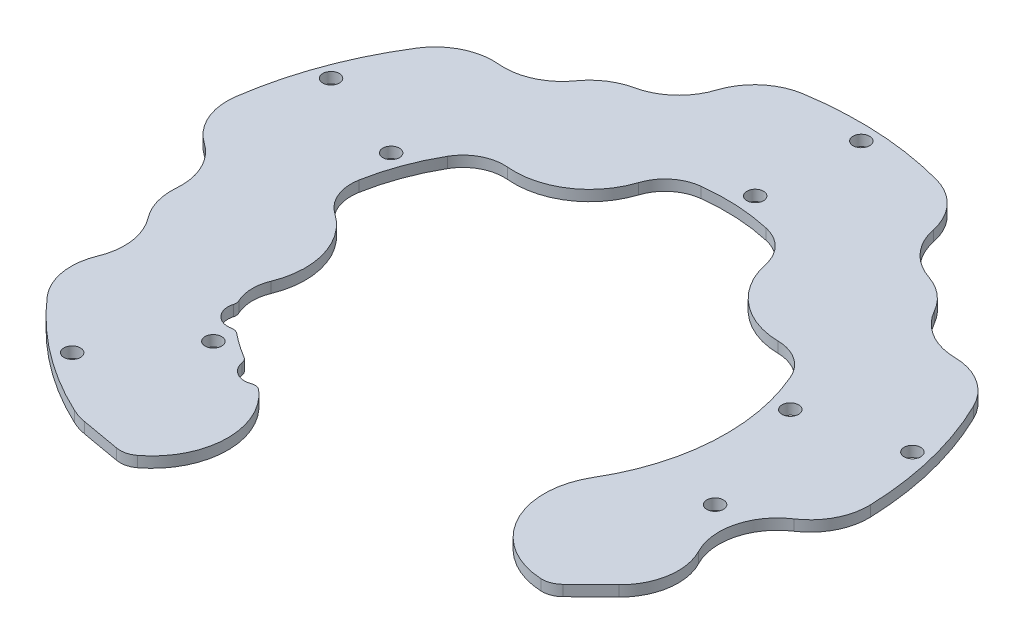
ISO-10303-21;
HEADER;
FILE_DESCRIPTION(('STEP AP214'),'2;1');
FILE_NAME('part.step','',(''),(''),'','','');
FILE_SCHEMA(('AUTOMOTIVE_DESIGN { 1 0 10303 214 1 1 1 1 }'));
ENDSEC;
DATA;
#1=APPLICATION_CONTEXT('core data for automotive mechanical design processes');
#2=APPLICATION_PROTOCOL_DEFINITION('international standard','automotive_design',2000,#1);
#3=PRODUCT_CONTEXT('',#1,'mechanical');
#4=PRODUCT('Part','Part','',(#3));
#5=PRODUCT_RELATED_PRODUCT_CATEGORY('part','',(#4));
#6=PRODUCT_DEFINITION_FORMATION('','',#4);
#7=PRODUCT_DEFINITION_CONTEXT('part definition',#1,'design');
#8=PRODUCT_DEFINITION('design','',#6,#7);
#9=PRODUCT_DEFINITION_SHAPE('','',#8);
#10=(LENGTH_UNIT() NAMED_UNIT(*) SI_UNIT(.MILLI.,.METRE.));
#11=(NAMED_UNIT(*) PLANE_ANGLE_UNIT() SI_UNIT($,.RADIAN.));
#12=(NAMED_UNIT(*) SI_UNIT($,.STERADIAN.) SOLID_ANGLE_UNIT());
#13=UNCERTAINTY_MEASURE_WITH_UNIT(LENGTH_MEASURE(1.E-05),#10,'distance_accuracy_value','');
#14=(GEOMETRIC_REPRESENTATION_CONTEXT(3) GLOBAL_UNCERTAINTY_ASSIGNED_CONTEXT((#13)) GLOBAL_UNIT_ASSIGNED_CONTEXT((#10,
#11,#12)) REPRESENTATION_CONTEXT('',''));
#15=CARTESIAN_POINT('',(0.,0.,0.));
#16=DIRECTION('',(0.,0.,1.));
#17=DIRECTION('',(1.,0.,0.));
#18=AXIS2_PLACEMENT_3D('',#15,#16,#17);
#19=CARTESIAN_POINT('',(-34.8871375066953,3.175,74.8157078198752));
#20=DIRECTION('',(0.,-1.,0.));
#21=DIRECTION('',(0.,0.,-1.));
#22=AXIS2_PLACEMENT_3D('',#19,#20,#21);
#23=CYLINDRICAL_SURFACE('',#22,17.272);
#24=DIRECTION('',(0.,1.,0.));
#25=VECTOR('',#24,1.);
#26=CARTESIAN_POINT('',(-37.8863888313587,-217.055004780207,91.825307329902));
#27=LINE('',#26,#25);
#28=CARTESIAN_POINT('',(-37.8863888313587,0.,91.825307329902));
#29=VERTEX_POINT('',#28);
#30=CARTESIAN_POINT('',(-37.8863888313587,3.175,91.825307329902));
#31=VERTEX_POINT('',#30);
#32=EDGE_CURVE('E49',#29,#31,#27,.T.);
#33=ORIENTED_EDGE('',*,*,#32,.T.);
#34=CARTESIAN_POINT('',(-34.8871375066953,3.175,74.8157078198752));
#35=DIRECTION('',(0.,1.,0.));
#36=DIRECTION('',(0.,0.,1.));
#37=AXIS2_PLACEMENT_3D('',#34,#35,#36);
#38=CIRCLE('',#37,17.272);
#39=CARTESIAN_POINT('',(-42.1866001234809,3.175,90.4694559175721));
#40=VERTEX_POINT('',#39);
#41=EDGE_CURVE('E531',#40,#31,#38,.T.);
#42=ORIENTED_EDGE('',*,*,#41,.F.);
#43=DIRECTION('',(0.,-1.,0.));
#44=VECTOR('',#43,1.);
#45=CARTESIAN_POINT('',(-42.1866001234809,3.175,90.4694559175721));
#46=LINE('',#45,#44);
#47=CARTESIAN_POINT('',(-42.1866001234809,0.,90.4694559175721));
#48=VERTEX_POINT('',#47);
#49=EDGE_CURVE('E533',#40,#48,#46,.T.);
#50=ORIENTED_EDGE('',*,*,#49,.T.);
#51=CARTESIAN_POINT('',(-34.8871375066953,0.,74.8157078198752));
#52=DIRECTION('',(0.,1.,0.));
#53=DIRECTION('',(0.,0.,1.));
#54=AXIS2_PLACEMENT_3D('',#51,#52,#53);
#55=CIRCLE('',#54,17.272);
#56=EDGE_CURVE('E489',#48,#29,#55,.T.);
#57=ORIENTED_EDGE('',*,*,#56,.T.);
#58=EDGE_LOOP('',(#33,#42,#50,#57));
#59=FACE_BOUND('',#58,.T.);
#60=ADVANCED_FACE('F34',(#59),#23,.T.);
#61=CARTESIAN_POINT('',(70.9491541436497,3.175,42.1985784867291));
#62=DIRECTION('',(0.,-1.,0.));
#63=DIRECTION('',(0.,0.,-1.));
#64=AXIS2_PLACEMENT_3D('',#61,#62,#63);
#65=CYLINDRICAL_SURFACE('',#64,17.272);
#66=CARTESIAN_POINT('',(70.9491541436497,3.175,42.1985784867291));
#67=DIRECTION('',(0.,1.,0.));
#68=DIRECTION('',(0.,0.,1.));
#69=AXIS2_PLACEMENT_3D('',#66,#67,#68);
#70=CIRCLE('',#69,17.272);
#71=CARTESIAN_POINT('',(83.0029020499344,3.175,54.569073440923));
#72=VERTEX_POINT('',#71);
#73=CARTESIAN_POINT('',(86.2498017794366,3.175,34.1853290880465));
#74=VERTEX_POINT('',#73);
#75=EDGE_CURVE('E57',#72,#74,#70,.T.);
#76=ORIENTED_EDGE('',*,*,#75,.F.);
#77=DIRECTION('',(0.,1.,0.));
#78=VECTOR('',#77,1.);
#79=CARTESIAN_POINT('',(83.0029020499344,-217.055004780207,54.569073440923));
#80=LINE('',#79,#78);
#81=CARTESIAN_POINT('',(83.0029020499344,0.,54.569073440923));
#82=VERTEX_POINT('',#81);
#83=EDGE_CURVE('E382',#82,#72,#80,.T.);
#84=ORIENTED_EDGE('',*,*,#83,.F.);
#85=CARTESIAN_POINT('',(70.9491541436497,0.,42.1985784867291));
#86=DIRECTION('',(0.,1.,0.));
#87=DIRECTION('',(0.,0.,1.));
#88=AXIS2_PLACEMENT_3D('',#85,#86,#87);
#89=CIRCLE('',#88,17.272);
#90=CARTESIAN_POINT('',(86.2498017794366,0.,34.1853290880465));
#91=VERTEX_POINT('',#90);
#92=EDGE_CURVE('E486',#82,#91,#89,.T.);
#93=ORIENTED_EDGE('',*,*,#92,.T.);
#94=DIRECTION('',(0.,-1.,0.));
#95=VECTOR('',#94,1.);
#96=CARTESIAN_POINT('',(86.2498017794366,3.175,34.1853290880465));
#97=LINE('',#96,#95);
#98=EDGE_CURVE('E11',#74,#91,#97,.T.);
#99=ORIENTED_EDGE('',*,*,#98,.F.);
#100=EDGE_LOOP('',(#76,#84,#93,#99));
#101=FACE_BOUND('',#100,.T.);
#102=ADVANCED_FACE('F36',(#101),#65,.T.);
#103=CARTESIAN_POINT('',(101.550449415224,3.175,26.1720796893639));
#104=DIRECTION('',(0.,-1.,0.));
#105=DIRECTION('',(0.,0.,-1.));
#106=AXIS2_PLACEMENT_3D('',#103,#104,#105);
#107=CYLINDRICAL_SURFACE('',#106,17.272);
#108=CARTESIAN_POINT('',(101.550449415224,0.,26.1720796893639));
#109=DIRECTION('',(0.,-1.,0.));
#110=DIRECTION('',(0.,0.,1.));
#111=AXIS2_PLACEMENT_3D('',#108,#109,#110);
#112=CIRCLE('',#111,17.272);
#113=CARTESIAN_POINT('',(92.0289681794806,0.,11.7615495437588));
#114=VERTEX_POINT('',#113);
#115=EDGE_CURVE('E535',#91,#114,#112,.T.);
#116=ORIENTED_EDGE('',*,*,#115,.T.);
#117=DIRECTION('',(0.,-1.,0.));
#118=VECTOR('',#117,1.);
#119=CARTESIAN_POINT('',(92.0289681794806,3.175,11.7615495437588));
#120=LINE('',#119,#118);
#121=CARTESIAN_POINT('',(92.0289681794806,3.175,11.7615495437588));
#122=VERTEX_POINT('',#121);
#123=EDGE_CURVE('E42',#122,#114,#120,.T.);
#124=ORIENTED_EDGE('',*,*,#123,.F.);
#125=CARTESIAN_POINT('',(101.550449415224,3.175,26.1720796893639));
#126=DIRECTION('',(0.,-1.,0.));
#127=DIRECTION('',(0.,0.,1.));
#128=AXIS2_PLACEMENT_3D('',#125,#126,#127);
#129=CIRCLE('',#128,17.272);
#130=EDGE_CURVE('E488',#74,#122,#129,.T.);
#131=ORIENTED_EDGE('',*,*,#130,.F.);
#132=ORIENTED_EDGE('',*,*,#98,.T.);
#133=EDGE_LOOP('',(#116,#124,#131,#132));
#134=FACE_BOUND('',#133,.T.);
#135=ADVANCED_FACE('F662',(#134),#107,.F.);
#136=CARTESIAN_POINT('',(82.5074869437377,3.175,-2.64898060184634));
#137=DIRECTION('',(0.,-1.,0.));
#138=DIRECTION('',(0.,0.,-1.));
#139=AXIS2_PLACEMENT_3D('',#136,#137,#138);
#140=CYLINDRICAL_SURFACE('',#139,17.272);
#141=CARTESIAN_POINT('',(82.5074869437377,0.,-2.64898060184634));
#142=DIRECTION('',(0.,1.,0.));
#143=DIRECTION('',(0.,0.,1.));
#144=AXIS2_PLACEMENT_3D('',#141,#142,#143);
#145=CIRCLE('',#144,17.272);
#146=CARTESIAN_POINT('',(99.7705919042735,0.,-3.20322885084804));
#147=VERTEX_POINT('',#146);
#148=EDGE_CURVE('E537',#114,#147,#145,.T.);
#149=ORIENTED_EDGE('',*,*,#148,.T.);
#150=DIRECTION('',(0.,-1.,0.));
#151=VECTOR('',#150,1.);
#152=CARTESIAN_POINT('',(99.7705919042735,3.175,-3.20322885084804));
#153=LINE('',#152,#151);
#154=CARTESIAN_POINT('',(99.7705919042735,3.175,-3.20322885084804));
#155=VERTEX_POINT('',#154);
#156=EDGE_CURVE('E634',#155,#147,#153,.T.);
#157=ORIENTED_EDGE('',*,*,#156,.F.);
#158=CARTESIAN_POINT('',(82.5074869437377,3.175,-2.64898060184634));
#159=DIRECTION('',(0.,1.,0.));
#160=DIRECTION('',(0.,0.,1.));
#161=AXIS2_PLACEMENT_3D('',#158,#159,#160);
#162=CIRCLE('',#161,17.272);
#163=EDGE_CURVE('E491',#122,#155,#162,.T.);
#164=ORIENTED_EDGE('',*,*,#163,.F.);
#165=ORIENTED_EDGE('',*,*,#123,.T.);
#166=EDGE_LOOP('',(#149,#157,#164,#165));
#167=FACE_BOUND('',#166,.T.);
#168=ADVANCED_FACE('F641',(#167),#140,.T.);
#169=CARTESIAN_POINT('',(0.,3.175,0.));
#170=DIRECTION('',(0.,-1.,0.));
#171=DIRECTION('',(0.,0.,-1.));
#172=AXIS2_PLACEMENT_3D('',#169,#170,#171);
#173=CYLINDRICAL_SURFACE('',#172,99.822);
#174=CARTESIAN_POINT('',(0.,0.,0.));
#175=DIRECTION('',(0.,1.,0.));
#176=DIRECTION('',(0.,0.,1.));
#177=AXIS2_PLACEMENT_3D('',#174,#175,#176);
#178=CIRCLE('',#177,99.822);
#179=CARTESIAN_POINT('',(89.7244153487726,0.,-43.7488396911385));
#180=VERTEX_POINT('',#179);
#181=EDGE_CURVE('E539',#147,#180,#178,.T.);
#182=ORIENTED_EDGE('',*,*,#181,.T.);
#183=DIRECTION('',(0.,-1.,0.));
#184=VECTOR('',#183,1.);
#185=CARTESIAN_POINT('',(89.7244153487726,3.175,-43.7488396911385));
#186=LINE('',#185,#184);
#187=CARTESIAN_POINT('',(89.7244153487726,3.175,-43.7488396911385));
#188=VERTEX_POINT('',#187);
#189=EDGE_CURVE('E631',#188,#180,#186,.T.);
#190=ORIENTED_EDGE('',*,*,#189,.F.);
#191=CARTESIAN_POINT('',(0.,3.175,0.));
#192=DIRECTION('',(0.,1.,0.));
#193=DIRECTION('',(0.,0.,1.));
#194=AXIS2_PLACEMENT_3D('',#191,#192,#193);
#195=CIRCLE('',#194,99.822);
#196=EDGE_CURVE('E493',#155,#188,#195,.T.);
#197=ORIENTED_EDGE('',*,*,#196,.F.);
#198=ORIENTED_EDGE('',*,*,#156,.T.);
#199=EDGE_LOOP('',(#182,#190,#197,#198));
#200=FACE_BOUND('',#199,.T.);
#201=ADVANCED_FACE('F651',(#200),#173,.T.);
#202=CARTESIAN_POINT('',(74.1995801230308,3.175,-36.179065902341));
#203=DIRECTION('',(0.,-1.,0.));
#204=DIRECTION('',(0.,0.,-1.));
#205=AXIS2_PLACEMENT_3D('',#202,#203,#204);
#206=CYLINDRICAL_SURFACE('',#205,17.272);
#207=CARTESIAN_POINT('',(74.1995801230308,0.,-36.179065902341));
#208=DIRECTION('',(0.,1.,0.));
#209=DIRECTION('',(0.,0.,1.));
#210=AXIS2_PLACEMENT_3D('',#207,#208,#209);
#211=CIRCLE('',#210,17.272);
#212=CARTESIAN_POINT('',(74.4213557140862,0.,-53.449642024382));
#213=VERTEX_POINT('',#212);
#214=EDGE_CURVE('E541',#180,#213,#211,.T.);
#215=ORIENTED_EDGE('',*,*,#214,.T.);
#216=DIRECTION('',(0.,-1.,0.));
#217=VECTOR('',#216,1.);
#218=CARTESIAN_POINT('',(74.4213557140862,3.175,-53.449642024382));
#219=LINE('',#218,#217);
#220=CARTESIAN_POINT('',(74.4213557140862,3.175,-53.449642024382));
#221=VERTEX_POINT('',#220);
#222=EDGE_CURVE('E628',#221,#213,#219,.T.);
#223=ORIENTED_EDGE('',*,*,#222,.F.);
#224=CARTESIAN_POINT('',(74.1995801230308,3.175,-36.179065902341));
#225=DIRECTION('',(0.,1.,0.));
#226=DIRECTION('',(0.,0.,1.));
#227=AXIS2_PLACEMENT_3D('',#224,#225,#226);
#228=CIRCLE('',#227,17.272);
#229=EDGE_CURVE('E495',#188,#221,#228,.T.);
#230=ORIENTED_EDGE('',*,*,#229,.F.);
#231=ORIENTED_EDGE('',*,*,#189,.T.);
#232=EDGE_LOOP('',(#215,#223,#230,#231));
#233=FACE_BOUND('',#232,.T.);
#234=ADVANCED_FACE('F655',(#233),#206,.T.);
#235=CARTESIAN_POINT('',(74.6431313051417,3.175,-70.720218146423));
#236=DIRECTION('',(0.,-1.,0.));
#237=DIRECTION('',(0.,0.,-1.));
#238=AXIS2_PLACEMENT_3D('',#235,#236,#237);
#239=CYLINDRICAL_SURFACE('',#238,17.272);
#240=CARTESIAN_POINT('',(74.6431313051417,0.,-70.720218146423));
#241=DIRECTION('',(0.,-1.,0.));
#242=DIRECTION('',(0.,0.,1.));
#243=AXIS2_PLACEMENT_3D('',#240,#241,#242);
#244=CIRCLE('',#243,17.272);
#245=CARTESIAN_POINT('',(59.5754858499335,0.,-62.2769933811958));
#246=VERTEX_POINT('',#245);
#247=EDGE_CURVE('E543',#213,#246,#244,.T.);
#248=ORIENTED_EDGE('',*,*,#247,.T.);
#249=DIRECTION('',(0.,-1.,0.));
#250=VECTOR('',#249,1.);
#251=CARTESIAN_POINT('',(59.5754858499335,3.175,-62.2769933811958));
#252=LINE('',#251,#250);
#253=CARTESIAN_POINT('',(59.5754858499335,3.175,-62.2769933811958));
#254=VERTEX_POINT('',#253);
#255=EDGE_CURVE('E625',#254,#246,#252,.T.);
#256=ORIENTED_EDGE('',*,*,#255,.F.);
#257=CARTESIAN_POINT('',(74.6431313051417,3.175,-70.720218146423));
#258=DIRECTION('',(0.,-1.,0.));
#259=DIRECTION('',(0.,0.,1.));
#260=AXIS2_PLACEMENT_3D('',#257,#258,#259);
#261=CIRCLE('',#260,17.272);
#262=EDGE_CURVE('E497',#221,#254,#261,.T.);
#263=ORIENTED_EDGE('',*,*,#262,.F.);
#264=ORIENTED_EDGE('',*,*,#222,.T.);
#265=EDGE_LOOP('',(#248,#256,#263,#264));
#266=FACE_BOUND('',#265,.T.);
#267=ADVANCED_FACE('F974',(#266),#239,.F.);
#268=CARTESIAN_POINT('',(44.5078403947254,3.175,-53.8337686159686));
#269=DIRECTION('',(0.,-1.,0.));
#270=DIRECTION('',(0.,0.,-1.));
#271=AXIS2_PLACEMENT_3D('',#268,#269,#270);
#272=CYLINDRICAL_SURFACE('',#271,17.272);
#273=CARTESIAN_POINT('',(44.5078403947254,0.,-53.8337686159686));
#274=DIRECTION('',(0.,1.,0.));
#275=DIRECTION('',(0.,0.,1.));
#276=AXIS2_PLACEMENT_3D('',#273,#274,#275);
#277=CIRCLE('',#276,17.272);
#278=CARTESIAN_POINT('',(49.9682395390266,0.,-70.2199220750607));
#279=VERTEX_POINT('',#278);
#280=EDGE_CURVE('E545',#246,#279,#277,.T.);
#281=ORIENTED_EDGE('',*,*,#280,.T.);
#282=DIRECTION('',(0.,-1.,0.));
#283=VECTOR('',#282,1.);
#284=CARTESIAN_POINT('',(49.9682395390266,3.175,-70.2199220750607));
#285=LINE('',#284,#283);
#286=CARTESIAN_POINT('',(49.9682395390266,3.175,-70.2199220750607));
#287=VERTEX_POINT('',#286);
#288=EDGE_CURVE('E622',#287,#279,#285,.T.);
#289=ORIENTED_EDGE('',*,*,#288,.F.);
#290=CARTESIAN_POINT('',(44.5078403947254,3.175,-53.8337686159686));
#291=DIRECTION('',(0.,1.,0.));
#292=DIRECTION('',(0.,0.,1.));
#293=AXIS2_PLACEMENT_3D('',#290,#291,#292);
#294=CIRCLE('',#293,17.272);
#295=EDGE_CURVE('E499',#254,#287,#294,.T.);
#296=ORIENTED_EDGE('',*,*,#295,.F.);
#297=ORIENTED_EDGE('',*,*,#255,.T.);
#298=EDGE_LOOP('',(#281,#289,#296,#297));
#299=FACE_BOUND('',#298,.T.);
#300=ADVANCED_FACE('F970',(#299),#272,.T.);
#301=CARTESIAN_POINT('',(55.4286386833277,3.175,-86.6060755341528));
#302=DIRECTION('',(0.,-1.,0.));
#303=DIRECTION('',(0.,0.,-1.));
#304=AXIS2_PLACEMENT_3D('',#301,#302,#303);
#305=CYLINDRICAL_SURFACE('',#304,17.272);
#306=CARTESIAN_POINT('',(55.4286386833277,0.,-86.6060755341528));
#307=DIRECTION('',(0.,-1.,0.));
#308=DIRECTION('',(0.,0.,1.));
#309=AXIS2_PLACEMENT_3D('',#306,#307,#308);
#310=CIRCLE('',#309,17.272);
#311=CARTESIAN_POINT('',(38.5076139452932,0.,-83.1418431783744));
#312=VERTEX_POINT('',#311);
#313=EDGE_CURVE('E547',#279,#312,#310,.T.);
#314=ORIENTED_EDGE('',*,*,#313,.T.);
#315=DIRECTION('',(0.,-1.,0.));
#316=VECTOR('',#315,1.);
#317=CARTESIAN_POINT('',(38.5076139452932,3.175,-83.1418431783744));
#318=LINE('',#317,#316);
#319=CARTESIAN_POINT('',(38.5076139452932,3.175,-83.1418431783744));
#320=VERTEX_POINT('',#319);
#321=EDGE_CURVE('E619',#320,#312,#318,.T.);
#322=ORIENTED_EDGE('',*,*,#321,.F.);
#323=CARTESIAN_POINT('',(55.4286386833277,3.175,-86.6060755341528));
#324=DIRECTION('',(0.,-1.,0.));
#325=DIRECTION('',(0.,0.,1.));
#326=AXIS2_PLACEMENT_3D('',#323,#324,#325);
#327=CIRCLE('',#326,17.272);
#328=EDGE_CURVE('E501',#287,#320,#327,.T.);
#329=ORIENTED_EDGE('',*,*,#328,.F.);
#330=ORIENTED_EDGE('',*,*,#288,.T.);
#331=EDGE_LOOP('',(#314,#322,#329,#330));
#332=FACE_BOUND('',#331,.T.);
#333=ADVANCED_FACE('F966',(#332),#305,.F.);
#334=CARTESIAN_POINT('',(21.5865892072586,3.175,-79.677610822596));
#335=DIRECTION('',(0.,-1.,0.));
#336=DIRECTION('',(0.,0.,-1.));
#337=AXIS2_PLACEMENT_3D('',#334,#335,#336);
#338=CYLINDRICAL_SURFACE('',#337,17.272);
#339=CARTESIAN_POINT('',(21.5865892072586,0.,-79.677610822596));
#340=DIRECTION('',(0.,1.,0.));
#341=DIRECTION('',(0.,0.,1.));
#342=AXIS2_PLACEMENT_3D('',#339,#340,#341);
#343=CIRCLE('',#342,17.272);
#344=CARTESIAN_POINT('',(26.1031678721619,0.,-96.3486186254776));
#345=VERTEX_POINT('',#344);
#346=EDGE_CURVE('E549',#312,#345,#343,.T.);
#347=ORIENTED_EDGE('',*,*,#346,.T.);
#348=DIRECTION('',(0.,-1.,0.));
#349=VECTOR('',#348,1.);
#350=CARTESIAN_POINT('',(26.1031678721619,3.175,-96.3486186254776));
#351=LINE('',#350,#349);
#352=CARTESIAN_POINT('',(26.1031678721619,3.175,-96.3486186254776));
#353=VERTEX_POINT('',#352);
#354=EDGE_CURVE('E616',#353,#345,#351,.T.);
#355=ORIENTED_EDGE('',*,*,#354,.F.);
#356=CARTESIAN_POINT('',(21.5865892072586,3.175,-79.677610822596));
#357=DIRECTION('',(0.,1.,0.));
#358=DIRECTION('',(0.,0.,1.));
#359=AXIS2_PLACEMENT_3D('',#356,#357,#358);
#360=CIRCLE('',#359,17.272);
#361=EDGE_CURVE('E503',#320,#353,#360,.T.);
#362=ORIENTED_EDGE('',*,*,#361,.F.);
#363=ORIENTED_EDGE('',*,*,#321,.T.);
#364=EDGE_LOOP('',(#347,#355,#362,#363));
#365=FACE_BOUND('',#364,.T.);
#366=ADVANCED_FACE('F962',(#365),#338,.T.);
#367=CARTESIAN_POINT('',(0.,3.175,0.));
#368=DIRECTION('',(0.,-1.,0.));
#369=DIRECTION('',(0.,0.,-1.));
#370=AXIS2_PLACEMENT_3D('',#367,#368,#369);
#371=CYLINDRICAL_SURFACE('',#370,99.822);
#372=CARTESIAN_POINT('',(0.,0.,0.));
#373=DIRECTION('',(0.,1.,0.));
#374=DIRECTION('',(0.,0.,1.));
#375=AXIS2_PLACEMENT_3D('',#372,#373,#374);
#376=CIRCLE('',#375,99.822);
#377=CARTESIAN_POINT('',(-15.6080958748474,0.,-98.5942139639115));
#378=VERTEX_POINT('',#377);
#379=EDGE_CURVE('E551',#345,#378,#376,.T.);
#380=ORIENTED_EDGE('',*,*,#379,.T.);
#381=DIRECTION('',(0.,-1.,0.));
#382=VECTOR('',#381,1.);
#383=CARTESIAN_POINT('',(-15.6080958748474,3.175,-98.5942139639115));
#384=LINE('',#383,#382);
#385=CARTESIAN_POINT('',(-15.6080958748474,3.175,-98.5942139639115));
#386=VERTEX_POINT('',#385);
#387=EDGE_CURVE('E613',#386,#378,#384,.T.);
#388=ORIENTED_EDGE('',*,*,#387,.F.);
#389=CARTESIAN_POINT('',(0.,3.175,0.));
#390=DIRECTION('',(0.,1.,0.));
#391=DIRECTION('',(0.,0.,1.));
#392=AXIS2_PLACEMENT_3D('',#389,#390,#391);
#393=CIRCLE('',#392,99.822);
#394=EDGE_CURVE('E505',#353,#386,#393,.T.);
#395=ORIENTED_EDGE('',*,*,#394,.F.);
#396=ORIENTED_EDGE('',*,*,#354,.T.);
#397=EDGE_LOOP('',(#380,#388,#395,#396));
#398=FACE_BOUND('',#397,.T.);
#399=ADVANCED_FACE('F958',(#398),#371,.T.);
#400=CARTESIAN_POINT('',(-12.9074584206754,3.175,-81.5346553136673));
#401=DIRECTION('',(0.,-1.,0.));
#402=DIRECTION('',(0.,0.,-1.));
#403=AXIS2_PLACEMENT_3D('',#400,#401,#402);
#404=CYLINDRICAL_SURFACE('',#403,17.272);
#405=CARTESIAN_POINT('',(-12.9074584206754,0.,-81.5346553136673));
#406=DIRECTION('',(0.,1.,0.));
#407=DIRECTION('',(0.,0.,1.));
#408=AXIS2_PLACEMENT_3D('',#405,#406,#407);
#409=CIRCLE('',#408,17.272);
#410=CARTESIAN_POINT('',(-29.3587518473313,0.,-86.7955419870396));
#411=VERTEX_POINT('',#410);
#412=EDGE_CURVE('E553',#378,#411,#409,.T.);
#413=ORIENTED_EDGE('',*,*,#412,.T.);
#414=DIRECTION('',(0.,-1.,0.));
#415=VECTOR('',#414,1.);
#416=CARTESIAN_POINT('',(-29.3587518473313,3.175,-86.7955419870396));
#417=LINE('',#416,#415);
#418=CARTESIAN_POINT('',(-29.3587518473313,3.175,-86.7955419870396));
#419=VERTEX_POINT('',#418);
#420=EDGE_CURVE('E610',#419,#411,#417,.T.);
#421=ORIENTED_EDGE('',*,*,#420,.F.);
#422=CARTESIAN_POINT('',(-12.9074584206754,3.175,-81.5346553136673));
#423=DIRECTION('',(0.,1.,0.));
#424=DIRECTION('',(0.,0.,1.));
#425=AXIS2_PLACEMENT_3D('',#422,#423,#424);
#426=CIRCLE('',#425,17.272);
#427=EDGE_CURVE('E507',#386,#419,#426,.T.);
#428=ORIENTED_EDGE('',*,*,#427,.F.);
#429=ORIENTED_EDGE('',*,*,#387,.T.);
#430=EDGE_LOOP('',(#413,#421,#428,#429));
#431=FACE_BOUND('',#430,.T.);
#432=ADVANCED_FACE('F954',(#431),#404,.T.);
#433=CARTESIAN_POINT('',(-45.8100452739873,3.175,-92.0564286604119));
#434=DIRECTION('',(0.,-1.,0.));
#435=DIRECTION('',(0.,0.,-1.));
#436=AXIS2_PLACEMENT_3D('',#433,#434,#435);
#437=CYLINDRICAL_SURFACE('',#436,17.272);
#438=CARTESIAN_POINT('',(-45.8100452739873,0.,-92.0564286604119));
#439=DIRECTION('',(0.,-1.,0.));
#440=DIRECTION('',(0.,0.,1.));
#441=AXIS2_PLACEMENT_3D('',#438,#439,#440);
#442=CIRCLE('',#441,17.272);
#443=CARTESIAN_POINT('',(-42.1404600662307,0.,-75.1787472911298));
#444=VERTEX_POINT('',#443);
#445=EDGE_CURVE('E555',#411,#444,#442,.T.);
#446=ORIENTED_EDGE('',*,*,#445,.T.);
#447=DIRECTION('',(0.,-1.,0.));
#448=VECTOR('',#447,1.);
#449=CARTESIAN_POINT('',(-42.1404600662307,3.175,-75.1787472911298));
#450=LINE('',#449,#448);
#451=CARTESIAN_POINT('',(-42.1404600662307,3.175,-75.1787472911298));
#452=VERTEX_POINT('',#451);
#453=EDGE_CURVE('E607',#452,#444,#450,.T.);
#454=ORIENTED_EDGE('',*,*,#453,.F.);
#455=CARTESIAN_POINT('',(-45.8100452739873,3.175,-92.0564286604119));
#456=DIRECTION('',(0.,-1.,0.));
#457=DIRECTION('',(0.,0.,1.));
#458=AXIS2_PLACEMENT_3D('',#455,#456,#457);
#459=CIRCLE('',#458,17.272);
#460=EDGE_CURVE('E509',#419,#452,#459,.T.);
#461=ORIENTED_EDGE('',*,*,#460,.F.);
#462=ORIENTED_EDGE('',*,*,#420,.T.);
#463=EDGE_LOOP('',(#446,#454,#461,#462));
#464=FACE_BOUND('',#463,.T.);
#465=ADVANCED_FACE('F950',(#464),#437,.F.);
#466=CARTESIAN_POINT('',(-38.4708748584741,3.175,-58.3010659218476));
#467=DIRECTION('',(0.,-1.,0.));
#468=DIRECTION('',(0.,0.,-1.));
#469=AXIS2_PLACEMENT_3D('',#466,#467,#468);
#470=CYLINDRICAL_SURFACE('',#469,17.272);
#471=CARTESIAN_POINT('',(-38.4708748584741,0.,-58.3010659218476));
#472=DIRECTION('',(0.,1.,0.));
#473=DIRECTION('',(0.,0.,1.));
#474=AXIS2_PLACEMENT_3D('',#471,#472,#473);
#475=CIRCLE('',#474,17.272);
#476=CARTESIAN_POINT('',(-52.5449462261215,0.,-68.3131835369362));
#477=VERTEX_POINT('',#476);
#478=EDGE_CURVE('E557',#444,#477,#475,.T.);
#479=ORIENTED_EDGE('',*,*,#478,.T.);
#480=DIRECTION('',(0.,-1.,0.));
#481=VECTOR('',#480,1.);
#482=CARTESIAN_POINT('',(-52.5449462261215,3.175,-68.3131835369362));
#483=LINE('',#482,#481);
#484=CARTESIAN_POINT('',(-52.5449462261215,3.175,-68.3131835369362));
#485=VERTEX_POINT('',#484);
#486=EDGE_CURVE('E604',#485,#477,#483,.T.);
#487=ORIENTED_EDGE('',*,*,#486,.F.);
#488=CARTESIAN_POINT('',(-38.4708748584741,3.175,-58.3010659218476));
#489=DIRECTION('',(0.,1.,0.));
#490=DIRECTION('',(0.,0.,1.));
#491=AXIS2_PLACEMENT_3D('',#488,#489,#490);
#492=CIRCLE('',#491,17.272);
#493=EDGE_CURVE('E511',#452,#485,#492,.T.);
#494=ORIENTED_EDGE('',*,*,#493,.F.);
#495=ORIENTED_EDGE('',*,*,#453,.T.);
#496=EDGE_LOOP('',(#479,#487,#494,#495));
#497=FACE_BOUND('',#496,.T.);
#498=ADVANCED_FACE('F946',(#497),#470,.T.);
#499=CARTESIAN_POINT('',(-66.619017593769,3.175,-78.3253011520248));
#500=DIRECTION('',(0.,-1.,0.));
#501=DIRECTION('',(0.,0.,-1.));
#502=AXIS2_PLACEMENT_3D('',#499,#500,#501);
#503=CYLINDRICAL_SURFACE('',#502,17.272);
#504=CARTESIAN_POINT('',(-66.619017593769,0.,-78.3253011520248));
#505=DIRECTION('',(0.,-1.,0.));
#506=DIRECTION('',(0.,0.,1.));
#507=AXIS2_PLACEMENT_3D('',#504,#505,#506);
#508=CIRCLE('',#507,17.272);
#509=CARTESIAN_POINT('',(-68.2527301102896,0.,-61.1307390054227));
#510=VERTEX_POINT('',#509);
#511=EDGE_CURVE('E559',#477,#510,#508,.T.);
#512=ORIENTED_EDGE('',*,*,#511,.T.);
#513=DIRECTION('',(0.,-1.,0.));
#514=VECTOR('',#513,1.);
#515=CARTESIAN_POINT('',(-68.2527301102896,3.175,-61.1307390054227));
#516=LINE('',#515,#514);
#517=CARTESIAN_POINT('',(-68.2527301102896,3.175,-61.1307390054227));
#518=VERTEX_POINT('',#517);
#519=EDGE_CURVE('E601',#518,#510,#516,.T.);
#520=ORIENTED_EDGE('',*,*,#519,.F.);
#521=CARTESIAN_POINT('',(-66.619017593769,3.175,-78.3253011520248));
#522=DIRECTION('',(0.,-1.,0.));
#523=DIRECTION('',(0.,0.,1.));
#524=AXIS2_PLACEMENT_3D('',#521,#522,#523);
#525=CIRCLE('',#524,17.272);
#526=EDGE_CURVE('E513',#485,#518,#525,.T.);
#527=ORIENTED_EDGE('',*,*,#526,.F.);
#528=ORIENTED_EDGE('',*,*,#486,.T.);
#529=EDGE_LOOP('',(#512,#520,#527,#528));
#530=FACE_BOUND('',#529,.T.);
#531=ADVANCED_FACE('F942',(#530),#503,.F.);
#532=CARTESIAN_POINT('',(-69.8864426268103,3.175,-43.9361768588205));
#533=DIRECTION('',(0.,-1.,0.));
#534=DIRECTION('',(0.,0.,-1.));
#535=AXIS2_PLACEMENT_3D('',#532,#533,#534);
#536=CYLINDRICAL_SURFACE('',#535,17.272);
#537=CARTESIAN_POINT('',(-69.8864426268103,0.,-43.9361768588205));
#538=DIRECTION('',(0.,1.,0.));
#539=DIRECTION('',(0.,0.,1.));
#540=AXIS2_PLACEMENT_3D('',#537,#538,#539);
#541=CIRCLE('',#540,17.272);
#542=CARTESIAN_POINT('',(-84.5088367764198,0.,-53.1289769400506));
#543=VERTEX_POINT('',#542);
#544=EDGE_CURVE('E561',#510,#543,#541,.T.);
#545=ORIENTED_EDGE('',*,*,#544,.T.);
#546=DIRECTION('',(0.,-1.,0.));
#547=VECTOR('',#546,1.);
#548=CARTESIAN_POINT('',(-84.5088367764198,3.175,-53.1289769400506));
#549=LINE('',#548,#547);
#550=CARTESIAN_POINT('',(-84.5088367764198,3.175,-53.1289769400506));
#551=VERTEX_POINT('',#550);
#552=EDGE_CURVE('E598',#551,#543,#549,.T.);
#553=ORIENTED_EDGE('',*,*,#552,.F.);
#554=CARTESIAN_POINT('',(-69.8864426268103,3.175,-43.9361768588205));
#555=DIRECTION('',(0.,1.,0.));
#556=DIRECTION('',(0.,0.,1.));
#557=AXIS2_PLACEMENT_3D('',#554,#555,#556);
#558=CIRCLE('',#557,17.272);
#559=EDGE_CURVE('E515',#518,#551,#558,.T.);
#560=ORIENTED_EDGE('',*,*,#559,.F.);
#561=ORIENTED_EDGE('',*,*,#519,.T.);
#562=EDGE_LOOP('',(#545,#553,#560,#561));
#563=FACE_BOUND('',#562,.T.);
#564=ADVANCED_FACE('F938',(#563),#536,.T.);
#565=CARTESIAN_POINT('',(0.,3.175,0.));
#566=DIRECTION('',(0.,-1.,0.));
#567=DIRECTION('',(0.,0.,-1.));
#568=AXIS2_PLACEMENT_3D('',#565,#566,#567);
#569=CYLINDRICAL_SURFACE('',#568,99.822);
#570=CARTESIAN_POINT('',(0.,0.,0.));
#571=DIRECTION('',(0.,1.,0.));
#572=DIRECTION('',(0.,0.,1.));
#573=AXIS2_PLACEMENT_3D('',#570,#571,#572);
#574=CIRCLE('',#573,99.822);
#575=CARTESIAN_POINT('',(-98.8500103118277,0.,-13.8962996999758));
#576=VERTEX_POINT('',#575);
#577=EDGE_CURVE('E563',#543,#576,#574,.T.);
#578=ORIENTED_EDGE('',*,*,#577,.T.);
#579=DIRECTION('',(0.,-1.,0.));
#580=VECTOR('',#579,1.);
#581=CARTESIAN_POINT('',(-98.8500103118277,3.175,-13.8962996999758));
#582=LINE('',#581,#580);
#583=CARTESIAN_POINT('',(-98.8500103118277,3.175,-13.8962996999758));
#584=VERTEX_POINT('',#583);
#585=EDGE_CURVE('E595',#584,#576,#582,.T.);
#586=ORIENTED_EDGE('',*,*,#585,.F.);
#587=CARTESIAN_POINT('',(0.,3.175,0.));
#588=DIRECTION('',(0.,1.,0.));
#589=DIRECTION('',(0.,0.,1.));
#590=AXIS2_PLACEMENT_3D('',#587,#588,#589);
#591=CIRCLE('',#590,99.822);
#592=EDGE_CURVE('E517',#551,#584,#591,.T.);
#593=ORIENTED_EDGE('',*,*,#592,.F.);
#594=ORIENTED_EDGE('',*,*,#552,.T.);
#595=EDGE_LOOP('',(#578,#586,#593,#594));
#596=FACE_BOUND('',#595,.T.);
#597=ADVANCED_FACE('F934',(#596),#569,.T.);
#598=CARTESIAN_POINT('',(-81.7461917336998,3.175,-11.4918508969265));
#599=DIRECTION('',(0.,-1.,0.));
#600=DIRECTION('',(0.,0.,-1.));
#601=AXIS2_PLACEMENT_3D('',#598,#599,#600);
#602=CYLINDRICAL_SURFACE('',#601,17.272);
#603=CARTESIAN_POINT('',(-81.7461917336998,0.,-11.4918508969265));
#604=DIRECTION('',(0.,1.,0.));
#605=DIRECTION('',(0.,0.,1.));
#606=AXIS2_PLACEMENT_3D('',#603,#604,#605);
#607=CIRCLE('',#606,17.272);
#608=CARTESIAN_POINT('',(-91.5865551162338,0.,2.70283939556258));
#609=VERTEX_POINT('',#608);
#610=EDGE_CURVE('E565',#576,#609,#607,.T.);
#611=ORIENTED_EDGE('',*,*,#610,.T.);
#612=DIRECTION('',(0.,-1.,0.));
#613=VECTOR('',#612,1.);
#614=CARTESIAN_POINT('',(-91.5865551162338,3.175,2.70283939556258));
#615=LINE('',#614,#613);
#616=CARTESIAN_POINT('',(-91.5865551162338,3.175,2.70283939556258));
#617=VERTEX_POINT('',#616);
#618=EDGE_CURVE('E592',#617,#609,#615,.T.);
#619=ORIENTED_EDGE('',*,*,#618,.F.);
#620=CARTESIAN_POINT('',(-81.7461917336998,3.175,-11.4918508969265));
#621=DIRECTION('',(0.,1.,0.));
#622=DIRECTION('',(0.,0.,1.));
#623=AXIS2_PLACEMENT_3D('',#620,#621,#622);
#624=CIRCLE('',#623,17.272);
#625=EDGE_CURVE('E519',#584,#617,#624,.T.);
#626=ORIENTED_EDGE('',*,*,#625,.F.);
#627=ORIENTED_EDGE('',*,*,#585,.T.);
#628=EDGE_LOOP('',(#611,#619,#626,#627));
#629=FACE_BOUND('',#628,.T.);
#630=ADVANCED_FACE('F930',(#629),#602,.T.);
#631=CARTESIAN_POINT('',(-101.426918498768,3.175,16.8975296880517));
#632=DIRECTION('',(0.,-1.,0.));
#633=DIRECTION('',(0.,0.,-1.));
#634=AXIS2_PLACEMENT_3D('',#631,#632,#633);
#635=CYLINDRICAL_SURFACE('',#634,17.272);
#636=CARTESIAN_POINT('',(-101.426918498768,0.,16.8975296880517));
#637=DIRECTION('',(0.,-1.,0.));
#638=DIRECTION('',(0.,0.,-1.));
#639=AXIS2_PLACEMENT_3D('',#636,#637,#638);
#640=CIRCLE('',#639,17.272);
#641=CARTESIAN_POINT('',(-84.2137744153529,0.,18.3221892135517));
#642=VERTEX_POINT('',#641);
#643=EDGE_CURVE('E567',#609,#642,#640,.T.);
#644=ORIENTED_EDGE('',*,*,#643,.T.);
#645=DIRECTION('',(0.,-1.,0.));
#646=VECTOR('',#645,1.);
#647=CARTESIAN_POINT('',(-84.2137744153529,3.175,18.3221892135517));
#648=LINE('',#647,#646);
#649=CARTESIAN_POINT('',(-84.2137744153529,3.175,18.3221892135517));
#650=VERTEX_POINT('',#649);
#651=EDGE_CURVE('E589',#650,#642,#648,.T.);
#652=ORIENTED_EDGE('',*,*,#651,.F.);
#653=CARTESIAN_POINT('',(-101.426918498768,3.175,16.8975296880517));
#654=DIRECTION('',(0.,-1.,0.));
#655=DIRECTION('',(0.,0.,-1.));
#656=AXIS2_PLACEMENT_3D('',#653,#654,#655);
#657=CIRCLE('',#656,17.272);
#658=EDGE_CURVE('E521',#617,#650,#657,.T.);
#659=ORIENTED_EDGE('',*,*,#658,.F.);
#660=ORIENTED_EDGE('',*,*,#618,.T.);
#661=EDGE_LOOP('',(#644,#652,#659,#660));
#662=FACE_BOUND('',#661,.T.);
#663=ADVANCED_FACE('F926',(#662),#635,.F.);
#664=CARTESIAN_POINT('',(-67.000630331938,3.175,19.7468487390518));
#665=DIRECTION('',(0.,-1.,0.));
#666=DIRECTION('',(0.,0.,-1.));
#667=AXIS2_PLACEMENT_3D('',#664,#665,#666);
#668=CYLINDRICAL_SURFACE('',#667,17.272);
#669=CARTESIAN_POINT('',(-67.000630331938,0.,19.7468487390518));
#670=DIRECTION('',(0.,1.,0.));
#671=DIRECTION('',(0.,0.,1.));
#672=AXIS2_PLACEMENT_3D('',#669,#670,#671);
#673=CIRCLE('',#672,17.272);
#674=CARTESIAN_POINT('',(-80.6897253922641,0.,30.2792112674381));
#675=VERTEX_POINT('',#674);
#676=EDGE_CURVE('E569',#642,#675,#673,.T.);
#677=ORIENTED_EDGE('',*,*,#676,.T.);
#678=DIRECTION('',(0.,-1.,0.));
#679=VECTOR('',#678,1.);
#680=CARTESIAN_POINT('',(-80.6897253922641,3.175,30.2792112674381));
#681=LINE('',#680,#679);
#682=CARTESIAN_POINT('',(-80.6897253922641,3.175,30.2792112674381));
#683=VERTEX_POINT('',#682);
#684=EDGE_CURVE('E586',#683,#675,#681,.T.);
#685=ORIENTED_EDGE('',*,*,#684,.F.);
#686=CARTESIAN_POINT('',(-67.000630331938,3.175,19.7468487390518));
#687=DIRECTION('',(0.,1.,0.));
#688=DIRECTION('',(0.,0.,1.));
#689=AXIS2_PLACEMENT_3D('',#686,#687,#688);
#690=CIRCLE('',#689,17.272);
#691=EDGE_CURVE('E523',#650,#683,#690,.T.);
#692=ORIENTED_EDGE('',*,*,#691,.F.);
#693=ORIENTED_EDGE('',*,*,#651,.T.);
#694=EDGE_LOOP('',(#677,#685,#692,#693));
#695=FACE_BOUND('',#694,.T.);
#696=ADVANCED_FACE('F922',(#695),#668,.T.);
#697=CARTESIAN_POINT('',(-94.3788204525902,3.175,40.8115737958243));
#698=DIRECTION('',(0.,-1.,0.));
#699=DIRECTION('',(0.,0.,-1.));
#700=AXIS2_PLACEMENT_3D('',#697,#698,#699);
#701=CYLINDRICAL_SURFACE('',#700,17.272);
#702=CARTESIAN_POINT('',(-94.3788204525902,0.,40.8115737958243));
#703=DIRECTION('',(0.,-1.,0.));
#704=DIRECTION('',(0.,0.,-1.));
#705=AXIS2_PLACEMENT_3D('',#702,#703,#704);
#706=CIRCLE('',#705,17.272);
#707=CARTESIAN_POINT('',(-78.4129794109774,0.,47.4004966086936));
#708=VERTEX_POINT('',#707);
#709=EDGE_CURVE('E571',#675,#708,#706,.T.);
#710=ORIENTED_EDGE('',*,*,#709,.T.);
#711=DIRECTION('',(0.,-1.,0.));
#712=VECTOR('',#711,1.);
#713=CARTESIAN_POINT('',(-78.4129794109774,3.175,47.4004966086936));
#714=LINE('',#713,#712);
#715=CARTESIAN_POINT('',(-78.4129794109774,3.175,47.4004966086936));
#716=VERTEX_POINT('',#715);
#717=EDGE_CURVE('E583',#716,#708,#714,.T.);
#718=ORIENTED_EDGE('',*,*,#717,.F.);
#719=CARTESIAN_POINT('',(-94.3788204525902,3.175,40.8115737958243));
#720=DIRECTION('',(0.,-1.,0.));
#721=DIRECTION('',(0.,0.,-1.));
#722=AXIS2_PLACEMENT_3D('',#719,#720,#721);
#723=CIRCLE('',#722,17.272);
#724=EDGE_CURVE('E525',#683,#716,#723,.T.);
#725=ORIENTED_EDGE('',*,*,#724,.F.);
#726=ORIENTED_EDGE('',*,*,#684,.T.);
#727=EDGE_LOOP('',(#710,#718,#725,#726));
#728=FACE_BOUND('',#727,.T.);
#729=ADVANCED_FACE('F918',(#728),#701,.F.);
#730=CARTESIAN_POINT('',(-62.4471383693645,3.175,53.989419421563));
#731=DIRECTION('',(0.,-1.,0.));
#732=DIRECTION('',(0.,0.,-1.));
#733=AXIS2_PLACEMENT_3D('',#730,#731,#732);
#734=CYLINDRICAL_SURFACE('',#733,17.272);
#735=CARTESIAN_POINT('',(-62.4471383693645,0.,53.989419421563));
#736=DIRECTION('',(0.,1.,0.));
#737=DIRECTION('',(0.,0.,1.));
#738=AXIS2_PLACEMENT_3D('',#735,#736,#737);
#739=CIRCLE('',#738,17.272);
#740=CARTESIAN_POINT('',(-75.5130011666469,0.,65.2856671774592));
#741=VERTEX_POINT('',#740);
#742=EDGE_CURVE('E573',#708,#741,#739,.T.);
#743=ORIENTED_EDGE('',*,*,#742,.T.);
#744=DIRECTION('',(0.,-1.,0.));
#745=VECTOR('',#744,1.);
#746=CARTESIAN_POINT('',(-75.5130011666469,3.175,65.2856671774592));
#747=LINE('',#746,#745);
#748=CARTESIAN_POINT('',(-75.5130011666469,3.175,65.2856671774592));
#749=VERTEX_POINT('',#748);
#750=EDGE_CURVE('E580',#749,#741,#747,.T.);
#751=ORIENTED_EDGE('',*,*,#750,.F.);
#752=CARTESIAN_POINT('',(-62.4471383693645,3.175,53.989419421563));
#753=DIRECTION('',(0.,1.,0.));
#754=DIRECTION('',(0.,0.,1.));
#755=AXIS2_PLACEMENT_3D('',#752,#753,#754);
#756=CIRCLE('',#755,17.272);
#757=EDGE_CURVE('E527',#716,#749,#756,.T.);
#758=ORIENTED_EDGE('',*,*,#757,.F.);
#759=ORIENTED_EDGE('',*,*,#717,.T.);
#760=EDGE_LOOP('',(#743,#751,#758,#759));
#761=FACE_BOUND('',#760,.T.);
#762=ADVANCED_FACE('F914',(#761),#734,.T.);
#763=CARTESIAN_POINT('',(0.,3.175,0.));
#764=DIRECTION('',(0.,-1.,0.));
#765=DIRECTION('',(0.,0.,-1.));
#766=AXIS2_PLACEMENT_3D('',#763,#764,#765);
#767=CYLINDRICAL_SURFACE('',#766,99.822);
#768=CARTESIAN_POINT('',(0.,0.,0.));
#769=DIRECTION('',(0.,1.,0.));
#770=DIRECTION('',(0.,0.,1.));
#771=AXIS2_PLACEMENT_3D('',#768,#769,#770);
#772=CIRCLE('',#771,99.822);
#773=EDGE_CURVE('E575',#741,#48,#772,.T.);
#774=ORIENTED_EDGE('',*,*,#773,.T.);
#775=ORIENTED_EDGE('',*,*,#49,.F.);
#776=CARTESIAN_POINT('',(0.,3.175,0.));
#777=DIRECTION('',(0.,1.,0.));
#778=DIRECTION('',(0.,0.,1.));
#779=AXIS2_PLACEMENT_3D('',#776,#777,#778);
#780=CIRCLE('',#779,99.822);
#781=EDGE_CURVE('E529',#749,#40,#780,.T.);
#782=ORIENTED_EDGE('',*,*,#781,.F.);
#783=ORIENTED_EDGE('',*,*,#750,.T.);
#784=EDGE_LOOP('',(#774,#775,#782,#783));
#785=FACE_BOUND('',#784,.T.);
#786=ADVANCED_FACE('F870',(#785),#767,.T.);
#787=CARTESIAN_POINT('',(21.9790357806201,3.175,-9.64707184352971));
#788=DIRECTION('',(0.,-1.,0.));
#789=DIRECTION('',(0.,0.,-1.));
#790=AXIS2_PLACEMENT_3D('',#787,#788,#789);
#791=PLANE('',#790);
#792=CARTESIAN_POINT('',(-57.4254275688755,3.175,75.992649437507));
#793=DIRECTION('',(0.,1.,0.));
#794=DIRECTION('',(0.,0.,1.));
#795=AXIS2_PLACEMENT_3D('',#792,#793,#794);
#796=CIRCLE('',#795,2.45744999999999);
#797=CARTESIAN_POINT('',(-57.4254275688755,3.175,78.4500994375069));
#798=VERTEX_POINT('',#797);
#799=EDGE_CURVE('E862',#798,#798,#796,.T.);
#800=ORIENTED_EDGE('',*,*,#799,.F.);
#801=EDGE_LOOP('',(#800));
#802=FACE_BOUND('',#801,.T.);
#803=CARTESIAN_POINT('',(-89.4604576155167,3.175,-32.7015140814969));
#804=DIRECTION('',(0.,1.,0.));
#805=DIRECTION('',(0.,0.,1.));
#806=AXIS2_PLACEMENT_3D('',#803,#804,#805);
#807=CIRCLE('',#806,2.45744999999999);
#808=CARTESIAN_POINT('',(-89.4604576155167,3.175,-30.2440640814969));
#809=VERTEX_POINT('',#808);
#810=EDGE_CURVE('E856',#809,#809,#807,.T.);
#811=ORIENTED_EDGE('',*,*,#810,.F.);
#812=EDGE_LOOP('',(#811));
#813=FACE_BOUND('',#812,.T.);
#814=CARTESIAN_POINT('',(5.12052708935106,3.175,-95.1122636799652));
#815=DIRECTION('',(0.,1.,0.));
#816=DIRECTION('',(0.,0.,1.));
#817=AXIS2_PLACEMENT_3D('',#814,#815,#816);
#818=CIRCLE('',#817,2.45744999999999);
#819=CARTESIAN_POINT('',(5.12052708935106,3.175,-92.6548136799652));
#820=VERTEX_POINT('',#819);
#821=EDGE_CURVE('E850',#820,#820,#818,.T.);
#822=ORIENTED_EDGE('',*,*,#821,.F.);
#823=EDGE_LOOP('',(#822));
#824=FACE_BOUND('',#823,.T.);
#825=CARTESIAN_POINT('',(92.4542793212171,3.175,-22.9078313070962));
#826=DIRECTION('',(0.,1.,0.));
#827=DIRECTION('',(0.,0.,1.));
#828=AXIS2_PLACEMENT_3D('',#825,#826,#827);
#829=CIRCLE('',#828,2.45744999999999);
#830=CARTESIAN_POINT('',(92.4542793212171,3.175,-20.4503813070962));
#831=VERTEX_POINT('',#830);
#832=EDGE_CURVE('E844',#831,#831,#829,.T.);
#833=ORIENTED_EDGE('',*,*,#832,.F.);
#834=EDGE_LOOP('',(#833));
#835=FACE_BOUND('',#834,.T.);
#836=CARTESIAN_POINT('',(76.7283205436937,3.175,19.7747989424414));
#837=DIRECTION('',(0.,1.,0.));
#838=DIRECTION('',(0.,0.,1.));
#839=AXIS2_PLACEMENT_3D('',#836,#837,#838);
#840=CIRCLE('',#839,2.45744999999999);
#841=CARTESIAN_POINT('',(76.7283205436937,3.175,22.2322489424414));
#842=VERTEX_POINT('',#841);
#843=EDGE_CURVE('E838',#842,#842,#840,.T.);
#844=ORIENTED_EDGE('',*,*,#843,.F.);
#845=EDGE_LOOP('',(#844));
#846=FACE_BOUND('',#845,.T.);
#847=CARTESIAN_POINT('',(-39.4321269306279,3.175,52.1816192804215));
#848=DIRECTION('',(0.,1.,0.));
#849=DIRECTION('',(0.,0.,1.));
#850=AXIS2_PLACEMENT_3D('',#847,#848,#849);
#851=CIRCLE('',#850,2.45744999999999);
#852=CARTESIAN_POINT('',(-39.4321269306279,3.175,54.6390692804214));
#853=VERTEX_POINT('',#852);
#854=EDGE_CURVE('E832',#853,#853,#851,.T.);
#855=ORIENTED_EDGE('',*,*,#854,.F.);
#856=EDGE_LOOP('',(#855));
#857=FACE_BOUND('',#856,.T.);
#858=CARTESIAN_POINT('',(-61.4295142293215,3.175,-22.4550396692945));
#859=DIRECTION('',(0.,1.,0.));
#860=DIRECTION('',(0.,0.,1.));
#861=AXIS2_PLACEMENT_3D('',#858,#859,#860);
#862=CIRCLE('',#861,2.45744999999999);
#863=CARTESIAN_POINT('',(-61.4295142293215,3.175,-19.9975896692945));
#864=VERTEX_POINT('',#863);
#865=EDGE_CURVE('E826',#864,#864,#862,.T.);
#866=ORIENTED_EDGE('',*,*,#865,.F.);
#867=EDGE_LOOP('',(#866));
#868=FACE_BOUND('',#867,.T.);
#869=CARTESIAN_POINT('',(3.51609526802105,3.175,-65.3104210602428));
#870=DIRECTION('',(0.,1.,0.));
#871=DIRECTION('',(0.,0.,1.));
#872=AXIS2_PLACEMENT_3D('',#869,#870,#871);
#873=CIRCLE('',#872,2.45744999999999);
#874=CARTESIAN_POINT('',(3.51609526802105,3.175,-62.8529710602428));
#875=VERTEX_POINT('',#874);
#876=EDGE_CURVE('E820',#875,#875,#873,.T.);
#877=ORIENTED_EDGE('',*,*,#876,.F.);
#878=EDGE_LOOP('',(#877));
#879=FACE_BOUND('',#878,.T.);
#880=CARTESIAN_POINT('',(63.4852718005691,3.175,-15.7300441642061));
#881=DIRECTION('',(0.,1.,0.));
#882=DIRECTION('',(0.,0.,1.));
#883=AXIS2_PLACEMENT_3D('',#880,#881,#882);
#884=CIRCLE('',#883,2.45744999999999);
#885=CARTESIAN_POINT('',(63.4852718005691,3.175,-13.2725941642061));
#886=VERTEX_POINT('',#885);
#887=EDGE_CURVE('E814',#886,#886,#884,.T.);
#888=ORIENTED_EDGE('',*,*,#887,.F.);
#889=EDGE_LOOP('',(#888));
#890=FACE_BOUND('',#889,.T.);
#891=DIRECTION('',(0.716216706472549,0.,-0.697877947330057));
#892=VECTOR('',#891,1.);
#893=CARTESIAN_POINT('',(83.0029020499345,3.175,54.569073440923));
#894=LINE('',#893,#892);
#895=CARTESIAN_POINT('',(74.6267202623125,3.175,62.7307827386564));
#896=VERTEX_POINT('',#895);
#897=EDGE_CURVE('E367',#896,#72,#894,.T.);
#898=ORIENTED_EDGE('',*,*,#897,.T.);
#899=ORIENTED_EDGE('',*,*,#75,.T.);
#900=ORIENTED_EDGE('',*,*,#130,.T.);
#901=ORIENTED_EDGE('',*,*,#163,.T.);
#902=ORIENTED_EDGE('',*,*,#196,.T.);
#903=ORIENTED_EDGE('',*,*,#229,.T.);
#904=ORIENTED_EDGE('',*,*,#262,.T.);
#905=ORIENTED_EDGE('',*,*,#295,.T.);
#906=ORIENTED_EDGE('',*,*,#328,.T.);
#907=ORIENTED_EDGE('',*,*,#361,.T.);
#908=ORIENTED_EDGE('',*,*,#394,.T.);
#909=ORIENTED_EDGE('',*,*,#427,.T.);
#910=ORIENTED_EDGE('',*,*,#460,.T.);
#911=ORIENTED_EDGE('',*,*,#493,.T.);
#912=ORIENTED_EDGE('',*,*,#526,.T.);
#913=ORIENTED_EDGE('',*,*,#559,.T.);
#914=ORIENTED_EDGE('',*,*,#592,.T.);
#915=ORIENTED_EDGE('',*,*,#625,.T.);
#916=ORIENTED_EDGE('',*,*,#658,.T.);
#917=ORIENTED_EDGE('',*,*,#691,.T.);
#918=ORIENTED_EDGE('',*,*,#724,.T.);
#919=ORIENTED_EDGE('',*,*,#757,.T.);
#920=ORIENTED_EDGE('',*,*,#781,.T.);
#921=ORIENTED_EDGE('',*,*,#41,.T.);
#922=DIRECTION('',(0.984807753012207,0.,0.173648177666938));
#923=VECTOR('',#922,1.);
#924=CARTESIAN_POINT('',(-37.8863888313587,3.175,91.825307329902));
#925=LINE('',#924,#923);
#926=CARTESIAN_POINT('',(-26.3690244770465,3.175,93.8561294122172));
#927=VERTEX_POINT('',#926);
#928=EDGE_CURVE('E364',#31,#927,#925,.T.);
#929=ORIENTED_EDGE('',*,*,#928,.T.);
#930=CARTESIAN_POINT('',(-25.2663585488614,3.175,87.6026001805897));
#931=DIRECTION('',(0.,1.,0.));
#932=DIRECTION('',(0.,0.,1.));
#933=AXIS2_PLACEMENT_3D('',#930,#931,#932);
#934=CIRCLE('',#933,6.35);
#935=CARTESIAN_POINT('',(-21.4485891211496,3.175,92.676763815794));
#936=VERTEX_POINT('',#935);
#937=EDGE_CURVE('E371',#927,#936,#934,.T.);
#938=ORIENTED_EDGE('',*,*,#937,.T.);
#939=CARTESIAN_POINT('',(-34.8871375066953,3.175,74.8157078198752));
#940=DIRECTION('',(0.,1.,0.));
#941=DIRECTION('',(0.,0.,1.));
#942=AXIS2_PLACEMENT_3D('',#939,#940,#941);
#943=CIRCLE('',#942,22.352);
#944=CARTESIAN_POINT('',(-20.3225017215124,3.175,57.8603756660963));
#945=VERTEX_POINT('',#944);
#946=EDGE_CURVE('E782',#936,#945,#943,.T.);
#947=ORIENTED_EDGE('',*,*,#946,.T.);
#948=CARTESIAN_POINT('',(-21.9775739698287,3.175,59.7871179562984));
#949=DIRECTION('',(0.,1.,0.));
#950=DIRECTION('',(0.,0.,-1.));
#951=AXIS2_PLACEMENT_3D('',#948,#949,#950);
#952=CIRCLE('',#951,2.54);
#953=CARTESIAN_POINT('',(-22.8652715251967,3.175,57.4072874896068));
#954=VERTEX_POINT('',#953);
#955=EDGE_CURVE('E356',#945,#954,#952,.T.);
#956=ORIENTED_EDGE('',*,*,#955,.T.);
#957=CARTESIAN_POINT('',(-24.6406666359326,3.175,52.6476265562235));
#958=DIRECTION('',(0.,-1.,0.));
#959=DIRECTION('',(0.,0.,1.));
#960=AXIS2_PLACEMENT_3D('',#957,#958,#959);
#961=CIRCLE('',#960,5.08);
#962=CARTESIAN_POINT('',(-29.6552262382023,3.175,53.4603946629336));
#963=VERTEX_POINT('',#962);
#964=EDGE_CURVE('E779',#954,#963,#961,.T.);
#965=ORIENTED_EDGE('',*,*,#964,.T.);
#966=CARTESIAN_POINT('',(-32.1625060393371,3.175,53.8667787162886));
#967=DIRECTION('',(0.,1.,0.));
#968=DIRECTION('',(0.,0.,1.));
#969=AXIS2_PLACEMENT_3D('',#966,#967,#968);
#970=CIRCLE('',#969,2.54);
#971=CARTESIAN_POINT('',(-30.8603802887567,3.175,51.6859374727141));
#972=VERTEX_POINT('',#971);
#973=EDGE_CURVE('E774',#963,#972,#970,.T.);
#974=ORIENTED_EDGE('',*,*,#973,.T.);
#975=CARTESIAN_POINT('',(0.,3.175,0.));
#976=DIRECTION('',(0.,-1.,0.));
#977=DIRECTION('',(0.,0.,1.));
#978=AXIS2_PLACEMENT_3D('',#975,#976,#977);
#979=CIRCLE('',#978,60.198);
#980=CARTESIAN_POINT('',(-38.0140223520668,3.175,46.6769033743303));
#981=VERTEX_POINT('',#980);
#982=EDGE_CURVE('E768',#972,#981,#979,.T.);
#983=ORIENTED_EDGE('',*,*,#982,.T.);
#984=CARTESIAN_POINT('',(-39.6179895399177,3.175,48.6463929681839));
#985=DIRECTION('',(0.,1.,0.));
#986=DIRECTION('',(0.,0.,-1.));
#987=AXIS2_PLACEMENT_3D('',#984,#985,#986);
#988=CIRCLE('',#987,2.54);
#989=CARTESIAN_POINT('',(-40.0936536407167,3.175,46.1513291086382));
#990=VERTEX_POINT('',#989);
#991=EDGE_CURVE('E763',#981,#990,#988,.T.);
#992=ORIENTED_EDGE('',*,*,#991,.T.);
#993=CARTESIAN_POINT('',(-41.0449818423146,3.175,41.1612013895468));
#994=DIRECTION('',(0.,-1.,0.));
#995=DIRECTION('',(0.,0.,1.));
#996=AXIS2_PLACEMENT_3D('',#993,#994,#995);
#997=CIRCLE('',#996,5.08000000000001);
#998=CARTESIAN_POINT('',(-45.9298585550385,3.175,39.7667912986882));
#999=VERTEX_POINT('',#998);
#1000=EDGE_CURVE('E788',#990,#999,#997,.T.);
#1001=ORIENTED_EDGE('',*,*,#1000,.T.);
#1002=CARTESIAN_POINT('',(-48.3722969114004,3.175,39.0695862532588));
#1003=DIRECTION('',(0.,1.,0.));
#1004=DIRECTION('',(0.,0.,1.));
#1005=AXIS2_PLACEMENT_3D('',#1002,#1003,#1004);
#1006=CIRCLE('',#1005,2.54);
#1007=CARTESIAN_POINT('',(-46.0716552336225,3.175,37.9931811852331));
#1008=VERTEX_POINT('',#1007);
#1009=EDGE_CURVE('E751',#999,#1008,#1006,.T.);
#1010=ORIENTED_EDGE('',*,*,#1009,.T.);
#1011=CARTESIAN_POINT('',(-35.0285751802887,3.175,32.8264368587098));
#1012=DIRECTION('',(0.,-1.,0.));
#1013=DIRECTION('',(0.,0.,1.));
#1014=AXIS2_PLACEMENT_3D('',#1011,#1012,#1013);
#1015=CIRCLE('',#1014,12.192);
#1016=CARTESIAN_POINT('',(-46.3128299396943,3.175,28.210111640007));
#1017=VERTEX_POINT('',#1016);
#1018=EDGE_CURVE('E746',#1008,#1017,#1015,.T.);
#1019=ORIENTED_EDGE('',*,*,#1018,.T.);
#1020=CARTESIAN_POINT('',(-67.000630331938,3.175,19.7468487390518));
#1021=DIRECTION('',(0.,1.,0.));
#1022=DIRECTION('',(0.,0.,1.));
#1023=AXIS2_PLACEMENT_3D('',#1020,#1021,#1022);
#1024=CIRCLE('',#1023,22.352);
#1025=CARTESIAN_POINT('',(-54.2096130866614,3.175,1.41649735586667));
#1026=VERTEX_POINT('',#1025);
#1027=EDGE_CURVE('E792',#1017,#1026,#1024,.T.);
#1028=ORIENTED_EDGE('',*,*,#1027,.T.);
#1029=CARTESIAN_POINT('',(-47.2326945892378,3.175,-8.58187612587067));
#1030=DIRECTION('',(0.,-1.,0.));
#1031=DIRECTION('',(0.,0.,1.));
#1032=AXIS2_PLACEMENT_3D('',#1029,#1030,#1031);
#1033=CIRCLE('',#1032,12.192);
#1034=CARTESIAN_POINT('',(-59.2282995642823,3.175,-10.7614002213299));
#1035=VERTEX_POINT('',#1034);
#1036=EDGE_CURVE('E734',#1026,#1035,#1033,.T.);
#1037=ORIENTED_EDGE('',*,*,#1036,.T.);
#1038=CARTESIAN_POINT('',(0.,3.175,0.));
#1039=DIRECTION('',(0.,-1.,0.));
#1040=DIRECTION('',(0.,0.,1.));
#1041=AXIS2_PLACEMENT_3D('',#1038,#1039,#1040);
#1042=CIRCLE('',#1041,60.198);
#1043=CARTESIAN_POINT('',(-52.2058737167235,3.175,-29.9724198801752));
#1044=VERTEX_POINT('',#1043);
#1045=EDGE_CURVE('E729',#1035,#1044,#1042,.T.);
#1046=ORIENTED_EDGE('',*,*,#1045,.T.);
#1047=CARTESIAN_POINT('',(-41.6325322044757,3.175,-23.9020563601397));
#1048=DIRECTION('',(0.,-1.,0.));
#1049=DIRECTION('',(0.,0.,1.));
#1050=AXIS2_PLACEMENT_3D('',#1047,#1048,#1049);
#1051=CIRCLE('',#1050,12.192);
#1052=CARTESIAN_POINT('',(-40.5166531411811,3.175,-36.0428832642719));
#1053=VERTEX_POINT('',#1052);
#1054=EDGE_CURVE('E796',#1044,#1053,#1051,.T.);
#1055=ORIENTED_EDGE('',*,*,#1054,.T.);
#1056=CARTESIAN_POINT('',(-38.4708748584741,3.175,-58.3010659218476));
#1057=DIRECTION('',(0.,1.,0.));
#1058=DIRECTION('',(0.,0.,1.));
#1059=AXIS2_PLACEMENT_3D('',#1056,#1057,#1058);
#1060=CIRCLE('',#1059,22.352);
#1061=CARTESIAN_POINT('',(-17.2020027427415,3.175,-51.4274218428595));
#1062=VERTEX_POINT('',#1061);
#1063=EDGE_CURVE('E717',#1053,#1062,#1060,.T.);
#1064=ORIENTED_EDGE('',*,*,#1063,.T.);
#1065=CARTESIAN_POINT('',(-5.60079977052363,3.175,-47.6781614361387));
#1066=DIRECTION('',(0.,-1.,0.));
#1067=DIRECTION('',(0.,0.,1.));
#1068=AXIS2_PLACEMENT_3D('',#1065,#1066,#1067);
#1069=CIRCLE('',#1068,12.192);
#1070=CARTESIAN_POINT('',(-7.02322510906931,3.175,-59.7869008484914));
#1071=VERTEX_POINT('',#1070);
#1072=EDGE_CURVE('E712',#1062,#1071,#1069,.T.);
#1073=ORIENTED_EDGE('',*,*,#1072,.T.);
#1074=CARTESIAN_POINT('',(0.,3.175,0.));
#1075=DIRECTION('',(0.,-1.,0.));
#1076=DIRECTION('',(0.,0.,1.));
#1077=AXIS2_PLACEMENT_3D('',#1074,#1075,#1076);
#1078=CIRCLE('',#1077,60.198);
#1079=CARTESIAN_POINT('',(13.4014811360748,3.175,-58.6873027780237));
#1080=VERTEX_POINT('',#1079);
#1081=EDGE_CURVE('E800',#1071,#1080,#1078,.T.);
#1082=ORIENTED_EDGE('',*,*,#1081,.T.);
#1083=CARTESIAN_POINT('',(10.6872571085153,3.175,-46.8012667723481));
#1084=DIRECTION('',(0.,-1.,0.));
#1085=DIRECTION('',(0.,0.,1.));
#1086=AXIS2_PLACEMENT_3D('',#1083,#1084,#1085);
#1087=CIRCLE('',#1086,12.192);
#1088=CARTESIAN_POINT('',(22.6239335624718,3.175,-49.2833262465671));
#1089=VERTEX_POINT('',#1088);
#1090=EDGE_CURVE('E700',#1080,#1089,#1087,.T.);
#1091=ORIENTED_EDGE('',*,*,#1090,.T.);
#1092=CARTESIAN_POINT('',(44.5078403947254,3.175,-53.8337686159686));
#1093=DIRECTION('',(0.,1.,0.));
#1094=DIRECTION('',(0.,0.,1.));
#1095=AXIS2_PLACEMENT_3D('',#1092,#1093,#1094);
#1096=CIRCLE('',#1095,22.352);
#1097=CARTESIAN_POINT('',(44.1521076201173,3.175,-31.4845995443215));
#1098=VERTEX_POINT('',#1097);
#1099=EDGE_CURVE('E695',#1089,#1098,#1096,.T.);
#1100=ORIENTED_EDGE('',*,*,#1099,.T.);
#1101=CARTESIAN_POINT('',(43.9580715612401,3.175,-19.2941436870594));
#1102=DIRECTION('',(0.,-1.,0.));
#1103=DIRECTION('',(0.,0.,1.));
#1104=AXIS2_PLACEMENT_3D('',#1101,#1102,#1103);
#1105=CIRCLE('',#1104,12.192);
#1106=CARTESIAN_POINT('',(55.1220262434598,3.175,-24.1942436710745));
#1107=VERTEX_POINT('',#1106);
#1108=EDGE_CURVE('E804',#1098,#1107,#1105,.T.);
#1109=ORIENTED_EDGE('',*,*,#1108,.T.);
#1110=CARTESIAN_POINT('',(0.,3.175,0.));
#1111=DIRECTION('',(0.,-1.,0.));
#1112=DIRECTION('',(0.,0.,1.));
#1113=AXIS2_PLACEMENT_3D('',#1110,#1111,#1112);
#1114=CIRCLE('',#1113,60.198);
#1115=CARTESIAN_POINT('',(51.7383062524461,3.175,30.7725018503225));
#1116=VERTEX_POINT('',#1115);
#1117=EDGE_CURVE('E683',#1107,#1116,#1114,.T.);
#1118=ORIENTED_EDGE('',*,*,#1117,.T.);
#1119=CARTESIAN_POINT('',(70.9491541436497,3.175,42.1985784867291));
#1120=DIRECTION('',(0.,1.,0.));
#1121=DIRECTION('',(0.,0.,1.));
#1122=AXIS2_PLACEMENT_3D('',#1119,#1120,#1121);
#1123=CIRCLE('',#1122,22.352);
#1124=CARTESIAN_POINT('',(69.8960052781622,3.175,64.5257543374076));
#1125=VERTEX_POINT('',#1124);
#1126=EDGE_CURVE('E678',#1116,#1125,#1123,.T.);
#1127=ORIENTED_EDGE('',*,*,#1126,.T.);
#1128=CARTESIAN_POINT('',(70.1951952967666,3.175,58.1828066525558));
#1129=DIRECTION('',(0.,1.,0.));
#1130=DIRECTION('',(0.,0.,1.));
#1131=AXIS2_PLACEMENT_3D('',#1128,#1129,#1130);
#1132=CIRCLE('',#1131,6.35);
#1133=EDGE_CURVE('E808',#1125,#896,#1132,.T.);
#1134=ORIENTED_EDGE('',*,*,#1133,.T.);
#1135=EDGE_LOOP('',(#898,#899,#900,#901,#902,#903,#904,#905,#906,#907,#908,#909,#910,#911,#912,
#913,#914,#915,#916,#917,#918,#919,#920,#921,#929,#938,#947,#956,#965,#974,#983,#992,#1001,
#1010,#1019,#1028,#1037,#1046,#1055,#1064,#1073,#1082,#1091,#1100,#1109,#1118,#1127,#1134));
#1136=FACE_BOUND('',#1135,.T.);
#1137=ADVANCED_FACE('F660',(#802,#813,#824,#835,#846,#857,#868,#879,#890,#1136),#791,.F.);
#1138=CARTESIAN_POINT('',(21.9790357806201,0.,-9.64707184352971));
#1139=DIRECTION('',(0.,-1.,0.));
#1140=DIRECTION('',(0.,0.,-1.));
#1141=AXIS2_PLACEMENT_3D('',#1138,#1139,#1140);
#1142=PLANE('',#1141);
#1143=CARTESIAN_POINT('',(-57.4254275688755,0.,75.992649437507));
#1144=DIRECTION('',(0.,1.,0.));
#1145=DIRECTION('',(0.,0.,1.));
#1146=AXIS2_PLACEMENT_3D('',#1143,#1144,#1145);
#1147=CIRCLE('',#1146,2.45745);
#1148=CARTESIAN_POINT('',(-57.4254275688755,0.,78.4500994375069));
#1149=VERTEX_POINT('',#1148);
#1150=EDGE_CURVE('E859',#1149,#1149,#1147,.T.);
#1151=ORIENTED_EDGE('',*,*,#1150,.T.);
#1152=EDGE_LOOP('',(#1151));
#1153=FACE_BOUND('',#1152,.T.);
#1154=CARTESIAN_POINT('',(-89.4604576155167,0.,-32.7015140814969));
#1155=DIRECTION('',(0.,1.,0.));
#1156=DIRECTION('',(0.,0.,1.));
#1157=AXIS2_PLACEMENT_3D('',#1154,#1155,#1156);
#1158=CIRCLE('',#1157,2.45745);
#1159=CARTESIAN_POINT('',(-89.4604576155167,0.,-30.2440640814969));
#1160=VERTEX_POINT('',#1159);
#1161=EDGE_CURVE('E853',#1160,#1160,#1158,.T.);
#1162=ORIENTED_EDGE('',*,*,#1161,.T.);
#1163=EDGE_LOOP('',(#1162));
#1164=FACE_BOUND('',#1163,.T.);
#1165=CARTESIAN_POINT('',(5.12052708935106,0.,-95.1122636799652));
#1166=DIRECTION('',(0.,1.,0.));
#1167=DIRECTION('',(0.,0.,1.));
#1168=AXIS2_PLACEMENT_3D('',#1165,#1166,#1167);
#1169=CIRCLE('',#1168,2.45745);
#1170=CARTESIAN_POINT('',(5.12052708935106,0.,-92.6548136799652));
#1171=VERTEX_POINT('',#1170);
#1172=EDGE_CURVE('E847',#1171,#1171,#1169,.T.);
#1173=ORIENTED_EDGE('',*,*,#1172,.T.);
#1174=EDGE_LOOP('',(#1173));
#1175=FACE_BOUND('',#1174,.T.);
#1176=CARTESIAN_POINT('',(92.4542793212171,0.,-22.9078313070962));
#1177=DIRECTION('',(0.,1.,0.));
#1178=DIRECTION('',(0.,0.,1.));
#1179=AXIS2_PLACEMENT_3D('',#1176,#1177,#1178);
#1180=CIRCLE('',#1179,2.45745);
#1181=CARTESIAN_POINT('',(92.4542793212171,0.,-20.4503813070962));
#1182=VERTEX_POINT('',#1181);
#1183=EDGE_CURVE('E841',#1182,#1182,#1180,.T.);
#1184=ORIENTED_EDGE('',*,*,#1183,.T.);
#1185=EDGE_LOOP('',(#1184));
#1186=FACE_BOUND('',#1185,.T.);
#1187=CARTESIAN_POINT('',(76.7283205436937,0.,19.7747989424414));
#1188=DIRECTION('',(0.,1.,0.));
#1189=DIRECTION('',(0.,0.,1.));
#1190=AXIS2_PLACEMENT_3D('',#1187,#1188,#1189);
#1191=CIRCLE('',#1190,2.45745);
#1192=CARTESIAN_POINT('',(76.7283205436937,0.,22.2322489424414));
#1193=VERTEX_POINT('',#1192);
#1194=EDGE_CURVE('E835',#1193,#1193,#1191,.T.);
#1195=ORIENTED_EDGE('',*,*,#1194,.T.);
#1196=EDGE_LOOP('',(#1195));
#1197=FACE_BOUND('',#1196,.T.);
#1198=CARTESIAN_POINT('',(-39.4321269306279,0.,52.1816192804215));
#1199=DIRECTION('',(0.,1.,0.));
#1200=DIRECTION('',(0.,0.,1.));
#1201=AXIS2_PLACEMENT_3D('',#1198,#1199,#1200);
#1202=CIRCLE('',#1201,2.45745);
#1203=CARTESIAN_POINT('',(-39.4321269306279,0.,54.6390692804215));
#1204=VERTEX_POINT('',#1203);
#1205=EDGE_CURVE('E829',#1204,#1204,#1202,.T.);
#1206=ORIENTED_EDGE('',*,*,#1205,.T.);
#1207=EDGE_LOOP('',(#1206));
#1208=FACE_BOUND('',#1207,.T.);
#1209=CARTESIAN_POINT('',(-61.4295142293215,0.,-22.4550396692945));
#1210=DIRECTION('',(0.,1.,0.));
#1211=DIRECTION('',(0.,0.,1.));
#1212=AXIS2_PLACEMENT_3D('',#1209,#1210,#1211);
#1213=CIRCLE('',#1212,2.45745);
#1214=CARTESIAN_POINT('',(-61.4295142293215,0.,-19.9975896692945));
#1215=VERTEX_POINT('',#1214);
#1216=EDGE_CURVE('E823',#1215,#1215,#1213,.T.);
#1217=ORIENTED_EDGE('',*,*,#1216,.T.);
#1218=EDGE_LOOP('',(#1217));
#1219=FACE_BOUND('',#1218,.T.);
#1220=CARTESIAN_POINT('',(3.51609526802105,0.,-65.3104210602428));
#1221=DIRECTION('',(0.,1.,0.));
#1222=DIRECTION('',(0.,0.,1.));
#1223=AXIS2_PLACEMENT_3D('',#1220,#1221,#1222);
#1224=CIRCLE('',#1223,2.45745);
#1225=CARTESIAN_POINT('',(3.51609526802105,0.,-62.8529710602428));
#1226=VERTEX_POINT('',#1225);
#1227=EDGE_CURVE('E817',#1226,#1226,#1224,.T.);
#1228=ORIENTED_EDGE('',*,*,#1227,.T.);
#1229=EDGE_LOOP('',(#1228));
#1230=FACE_BOUND('',#1229,.T.);
#1231=CARTESIAN_POINT('',(63.4852718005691,0.,-15.7300441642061));
#1232=DIRECTION('',(0.,1.,0.));
#1233=DIRECTION('',(0.,0.,1.));
#1234=AXIS2_PLACEMENT_3D('',#1231,#1232,#1233);
#1235=CIRCLE('',#1234,2.45745);
#1236=CARTESIAN_POINT('',(63.4852718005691,0.,-13.2725941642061));
#1237=VERTEX_POINT('',#1236);
#1238=EDGE_CURVE('E811',#1237,#1237,#1235,.T.);
#1239=ORIENTED_EDGE('',*,*,#1238,.T.);
#1240=EDGE_LOOP('',(#1239));
#1241=FACE_BOUND('',#1240,.T.);
#1242=ORIENTED_EDGE('',*,*,#92,.F.);
#1243=DIRECTION('',(0.716216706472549,0.,-0.697877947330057));
#1244=VECTOR('',#1243,1.);
#1245=CARTESIAN_POINT('',(83.0029020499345,0.,54.569073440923));
#1246=LINE('',#1245,#1244);
#1247=CARTESIAN_POINT('',(74.6267202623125,0.,62.7307827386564));
#1248=VERTEX_POINT('',#1247);
#1249=EDGE_CURVE('E379',#1248,#82,#1246,.T.);
#1250=ORIENTED_EDGE('',*,*,#1249,.F.);
#1251=CARTESIAN_POINT('',(70.1951952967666,0.,58.1828066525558));
#1252=DIRECTION('',(0.,-1.,0.));
#1253=DIRECTION('',(0.,0.,-1.));
#1254=AXIS2_PLACEMENT_3D('',#1251,#1252,#1253);
#1255=CIRCLE('',#1254,6.35);
#1256=CARTESIAN_POINT('',(69.8960052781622,0.,64.5257543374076));
#1257=VERTEX_POINT('',#1256);
#1258=EDGE_CURVE('E384',#1257,#1248,#1255,.F.);
#1259=ORIENTED_EDGE('',*,*,#1258,.F.);
#1260=CARTESIAN_POINT('',(70.9491541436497,0.,42.1985784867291));
#1261=DIRECTION('',(0.,-1.,0.));
#1262=DIRECTION('',(0.,0.,-1.));
#1263=AXIS2_PLACEMENT_3D('',#1260,#1261,#1262);
#1264=CIRCLE('',#1263,22.352);
#1265=CARTESIAN_POINT('',(51.7383062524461,0.,30.7725018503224));
#1266=VERTEX_POINT('',#1265);
#1267=EDGE_CURVE('E388',#1266,#1257,#1264,.F.);
#1268=ORIENTED_EDGE('',*,*,#1267,.F.);
#1269=CARTESIAN_POINT('',(0.,0.,0.));
#1270=DIRECTION('',(0.,-1.,0.));
#1271=DIRECTION('',(0.,0.,-1.));
#1272=AXIS2_PLACEMENT_3D('',#1269,#1270,#1271);
#1273=CIRCLE('',#1272,60.198);
#1274=CARTESIAN_POINT('',(55.1220262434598,0.,-24.1942436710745));
#1275=VERTEX_POINT('',#1274);
#1276=EDGE_CURVE('E392',#1275,#1266,#1273,.T.);
#1277=ORIENTED_EDGE('',*,*,#1276,.F.);
#1278=CARTESIAN_POINT('',(43.9580715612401,0.,-19.2941436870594));
#1279=DIRECTION('',(0.,-1.,0.));
#1280=DIRECTION('',(0.,0.,-1.));
#1281=AXIS2_PLACEMENT_3D('',#1278,#1279,#1280);
#1282=CIRCLE('',#1281,12.192);
#1283=CARTESIAN_POINT('',(44.1521076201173,0.,-31.4845995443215));
#1284=VERTEX_POINT('',#1283);
#1285=EDGE_CURVE('E396',#1284,#1275,#1282,.T.);
#1286=ORIENTED_EDGE('',*,*,#1285,.F.);
#1287=CARTESIAN_POINT('',(44.5078403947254,0.,-53.8337686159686));
#1288=DIRECTION('',(0.,-1.,0.));
#1289=DIRECTION('',(0.,0.,-1.));
#1290=AXIS2_PLACEMENT_3D('',#1287,#1288,#1289);
#1291=CIRCLE('',#1290,22.352);
#1292=CARTESIAN_POINT('',(22.6239335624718,0.,-49.2833262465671));
#1293=VERTEX_POINT('',#1292);
#1294=EDGE_CURVE('E400',#1293,#1284,#1291,.F.);
#1295=ORIENTED_EDGE('',*,*,#1294,.F.);
#1296=CARTESIAN_POINT('',(10.6872571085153,0.,-46.8012667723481));
#1297=DIRECTION('',(0.,-1.,0.));
#1298=DIRECTION('',(0.,0.,-1.));
#1299=AXIS2_PLACEMENT_3D('',#1296,#1297,#1298);
#1300=CIRCLE('',#1299,12.192);
#1301=CARTESIAN_POINT('',(13.4014811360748,0.,-58.6873027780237));
#1302=VERTEX_POINT('',#1301);
#1303=EDGE_CURVE('E404',#1302,#1293,#1300,.T.);
#1304=ORIENTED_EDGE('',*,*,#1303,.F.);
#1305=CARTESIAN_POINT('',(0.,0.,0.));
#1306=DIRECTION('',(0.,-1.,0.));
#1307=DIRECTION('',(0.,0.,-1.));
#1308=AXIS2_PLACEMENT_3D('',#1305,#1306,#1307);
#1309=CIRCLE('',#1308,60.198);
#1310=CARTESIAN_POINT('',(-7.02322510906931,0.,-59.7869008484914));
#1311=VERTEX_POINT('',#1310);
#1312=EDGE_CURVE('E408',#1311,#1302,#1309,.T.);
#1313=ORIENTED_EDGE('',*,*,#1312,.F.);
#1314=CARTESIAN_POINT('',(-5.60079977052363,0.,-47.6781614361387));
#1315=DIRECTION('',(0.,-1.,0.));
#1316=DIRECTION('',(0.,0.,-1.));
#1317=AXIS2_PLACEMENT_3D('',#1314,#1315,#1316);
#1318=CIRCLE('',#1317,12.192);
#1319=CARTESIAN_POINT('',(-17.2020027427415,0.,-51.4274218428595));
#1320=VERTEX_POINT('',#1319);
#1321=EDGE_CURVE('E412',#1320,#1311,#1318,.T.);
#1322=ORIENTED_EDGE('',*,*,#1321,.F.);
#1323=CARTESIAN_POINT('',(-38.4708748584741,0.,-58.3010659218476));
#1324=DIRECTION('',(0.,-1.,0.));
#1325=DIRECTION('',(0.,0.,-1.));
#1326=AXIS2_PLACEMENT_3D('',#1323,#1324,#1325);
#1327=CIRCLE('',#1326,22.352);
#1328=CARTESIAN_POINT('',(-40.5166531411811,0.,-36.0428832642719));
#1329=VERTEX_POINT('',#1328);
#1330=EDGE_CURVE('E416',#1329,#1320,#1327,.F.);
#1331=ORIENTED_EDGE('',*,*,#1330,.F.);
#1332=CARTESIAN_POINT('',(-41.6325322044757,0.,-23.9020563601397));
#1333=DIRECTION('',(0.,-1.,0.));
#1334=DIRECTION('',(0.,0.,-1.));
#1335=AXIS2_PLACEMENT_3D('',#1332,#1333,#1334);
#1336=CIRCLE('',#1335,12.192);
#1337=CARTESIAN_POINT('',(-52.2058737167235,0.,-29.9724198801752));
#1338=VERTEX_POINT('',#1337);
#1339=EDGE_CURVE('E420',#1338,#1329,#1336,.T.);
#1340=ORIENTED_EDGE('',*,*,#1339,.F.);
#1341=CARTESIAN_POINT('',(0.,0.,0.));
#1342=DIRECTION('',(0.,-1.,0.));
#1343=DIRECTION('',(0.,0.,-1.));
#1344=AXIS2_PLACEMENT_3D('',#1341,#1342,#1343);
#1345=CIRCLE('',#1344,60.198);
#1346=CARTESIAN_POINT('',(-59.2282995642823,0.,-10.7614002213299));
#1347=VERTEX_POINT('',#1346);
#1348=EDGE_CURVE('E424',#1347,#1338,#1345,.T.);
#1349=ORIENTED_EDGE('',*,*,#1348,.F.);
#1350=CARTESIAN_POINT('',(-47.2326945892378,0.,-8.58187612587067));
#1351=DIRECTION('',(0.,-1.,0.));
#1352=DIRECTION('',(0.,0.,-1.));
#1353=AXIS2_PLACEMENT_3D('',#1350,#1351,#1352);
#1354=CIRCLE('',#1353,12.192);
#1355=CARTESIAN_POINT('',(-54.2096130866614,0.,1.41649735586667));
#1356=VERTEX_POINT('',#1355);
#1357=EDGE_CURVE('E428',#1356,#1347,#1354,.T.);
#1358=ORIENTED_EDGE('',*,*,#1357,.F.);
#1359=CARTESIAN_POINT('',(-67.000630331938,0.,19.7468487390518));
#1360=DIRECTION('',(0.,-1.,0.));
#1361=DIRECTION('',(0.,0.,-1.));
#1362=AXIS2_PLACEMENT_3D('',#1359,#1360,#1361);
#1363=CIRCLE('',#1362,22.352);
#1364=CARTESIAN_POINT('',(-46.3128299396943,0.,28.210111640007));
#1365=VERTEX_POINT('',#1364);
#1366=EDGE_CURVE('E432',#1365,#1356,#1363,.F.);
#1367=ORIENTED_EDGE('',*,*,#1366,.F.);
#1368=CARTESIAN_POINT('',(-35.0285751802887,0.,32.8264368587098));
#1369=DIRECTION('',(0.,-1.,0.));
#1370=DIRECTION('',(0.,0.,-1.));
#1371=AXIS2_PLACEMENT_3D('',#1368,#1369,#1370);
#1372=CIRCLE('',#1371,12.192);
#1373=CARTESIAN_POINT('',(-46.0716552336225,0.,37.9931811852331));
#1374=VERTEX_POINT('',#1373);
#1375=EDGE_CURVE('E436',#1374,#1365,#1372,.T.);
#1376=ORIENTED_EDGE('',*,*,#1375,.F.);
#1377=CARTESIAN_POINT('',(-48.3722969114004,0.,39.0695862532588));
#1378=DIRECTION('',(0.,-1.,0.));
#1379=DIRECTION('',(0.,0.,-1.));
#1380=AXIS2_PLACEMENT_3D('',#1377,#1378,#1379);
#1381=CIRCLE('',#1380,2.54);
#1382=CARTESIAN_POINT('',(-45.9298585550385,0.,39.7667912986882));
#1383=VERTEX_POINT('',#1382);
#1384=EDGE_CURVE('E440',#1383,#1374,#1381,.F.);
#1385=ORIENTED_EDGE('',*,*,#1384,.F.);
#1386=CARTESIAN_POINT('',(-41.0449818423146,0.,41.1612013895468));
#1387=DIRECTION('',(0.,-1.,0.));
#1388=DIRECTION('',(0.,0.,-1.));
#1389=AXIS2_PLACEMENT_3D('',#1386,#1387,#1388);
#1390=CIRCLE('',#1389,5.08000000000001);
#1391=CARTESIAN_POINT('',(-40.0936536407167,0.,46.1513291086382));
#1392=VERTEX_POINT('',#1391);
#1393=EDGE_CURVE('E444',#1392,#1383,#1390,.T.);
#1394=ORIENTED_EDGE('',*,*,#1393,.F.);
#1395=CARTESIAN_POINT('',(-39.6179895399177,0.,48.6463929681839));
#1396=DIRECTION('',(0.,-1.,0.));
#1397=DIRECTION('',(0.,0.,-1.));
#1398=AXIS2_PLACEMENT_3D('',#1395,#1396,#1397);
#1399=CIRCLE('',#1398,2.54);
#1400=CARTESIAN_POINT('',(-38.0140223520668,0.,46.6769033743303));
#1401=VERTEX_POINT('',#1400);
#1402=EDGE_CURVE('E448',#1401,#1392,#1399,.F.);
#1403=ORIENTED_EDGE('',*,*,#1402,.F.);
#1404=CARTESIAN_POINT('',(0.,0.,0.));
#1405=DIRECTION('',(0.,-1.,0.));
#1406=DIRECTION('',(0.,0.,-1.));
#1407=AXIS2_PLACEMENT_3D('',#1404,#1405,#1406);
#1408=CIRCLE('',#1407,60.198);
#1409=CARTESIAN_POINT('',(-30.8603802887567,0.,51.6859374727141));
#1410=VERTEX_POINT('',#1409);
#1411=EDGE_CURVE('E452',#1410,#1401,#1408,.T.);
#1412=ORIENTED_EDGE('',*,*,#1411,.F.);
#1413=CARTESIAN_POINT('',(-32.1625060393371,0.,53.8667787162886));
#1414=DIRECTION('',(0.,-1.,0.));
#1415=DIRECTION('',(0.,0.,-1.));
#1416=AXIS2_PLACEMENT_3D('',#1413,#1414,#1415);
#1417=CIRCLE('',#1416,2.54);
#1418=CARTESIAN_POINT('',(-29.6552262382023,0.,53.4603946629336));
#1419=VERTEX_POINT('',#1418);
#1420=EDGE_CURVE('E456',#1419,#1410,#1417,.F.);
#1421=ORIENTED_EDGE('',*,*,#1420,.F.);
#1422=CARTESIAN_POINT('',(-24.6406666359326,0.,52.6476265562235));
#1423=DIRECTION('',(0.,-1.,0.));
#1424=DIRECTION('',(0.,0.,-1.));
#1425=AXIS2_PLACEMENT_3D('',#1422,#1423,#1424);
#1426=CIRCLE('',#1425,5.08);
#1427=CARTESIAN_POINT('',(-22.8652715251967,0.,57.4072874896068));
#1428=VERTEX_POINT('',#1427);
#1429=EDGE_CURVE('E347',#1428,#1419,#1426,.T.);
#1430=ORIENTED_EDGE('',*,*,#1429,.F.);
#1431=CARTESIAN_POINT('',(-21.9775739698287,0.,59.7871179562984));
#1432=DIRECTION('',(0.,-1.,0.));
#1433=DIRECTION('',(0.,0.,-1.));
#1434=AXIS2_PLACEMENT_3D('',#1431,#1432,#1433);
#1435=CIRCLE('',#1434,2.54);
#1436=CARTESIAN_POINT('',(-20.3225017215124,0.,57.8603756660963));
#1437=VERTEX_POINT('',#1436);
#1438=EDGE_CURVE('E339',#1437,#1428,#1435,.F.);
#1439=ORIENTED_EDGE('',*,*,#1438,.F.);
#1440=CARTESIAN_POINT('',(-34.8871375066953,0.,74.8157078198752));
#1441=DIRECTION('',(0.,-1.,0.));
#1442=DIRECTION('',(0.,0.,-1.));
#1443=AXIS2_PLACEMENT_3D('',#1440,#1441,#1442);
#1444=CIRCLE('',#1443,22.352);
#1445=CARTESIAN_POINT('',(-21.4485891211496,0.,92.676763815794));
#1446=VERTEX_POINT('',#1445);
#1447=EDGE_CURVE('E344',#1446,#1437,#1444,.F.);
#1448=ORIENTED_EDGE('',*,*,#1447,.F.);
#1449=CARTESIAN_POINT('',(-25.2663585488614,0.,87.6026001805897));
#1450=DIRECTION('',(0.,-1.,0.));
#1451=DIRECTION('',(0.,0.,-1.));
#1452=AXIS2_PLACEMENT_3D('',#1449,#1450,#1451);
#1453=CIRCLE('',#1452,6.35);
#1454=CARTESIAN_POINT('',(-26.3690244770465,0.,93.8561294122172));
#1455=VERTEX_POINT('',#1454);
#1456=EDGE_CURVE('E373',#1455,#1446,#1453,.F.);
#1457=ORIENTED_EDGE('',*,*,#1456,.F.);
#1458=DIRECTION('',(0.984807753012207,0.,0.173648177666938));
#1459=VECTOR('',#1458,1.);
#1460=CARTESIAN_POINT('',(-37.8863888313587,0.,91.825307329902));
#1461=LINE('',#1460,#1459);
#1462=EDGE_CURVE('E376',#29,#1455,#1461,.T.);
#1463=ORIENTED_EDGE('',*,*,#1462,.F.);
#1464=ORIENTED_EDGE('',*,*,#56,.F.);
#1465=ORIENTED_EDGE('',*,*,#773,.F.);
#1466=ORIENTED_EDGE('',*,*,#742,.F.);
#1467=ORIENTED_EDGE('',*,*,#709,.F.);
#1468=ORIENTED_EDGE('',*,*,#676,.F.);
#1469=ORIENTED_EDGE('',*,*,#643,.F.);
#1470=ORIENTED_EDGE('',*,*,#610,.F.);
#1471=ORIENTED_EDGE('',*,*,#577,.F.);
#1472=ORIENTED_EDGE('',*,*,#544,.F.);
#1473=ORIENTED_EDGE('',*,*,#511,.F.);
#1474=ORIENTED_EDGE('',*,*,#478,.F.);
#1475=ORIENTED_EDGE('',*,*,#445,.F.);
#1476=ORIENTED_EDGE('',*,*,#412,.F.);
#1477=ORIENTED_EDGE('',*,*,#379,.F.);
#1478=ORIENTED_EDGE('',*,*,#346,.F.);
#1479=ORIENTED_EDGE('',*,*,#313,.F.);
#1480=ORIENTED_EDGE('',*,*,#280,.F.);
#1481=ORIENTED_EDGE('',*,*,#247,.F.);
#1482=ORIENTED_EDGE('',*,*,#214,.F.);
#1483=ORIENTED_EDGE('',*,*,#181,.F.);
#1484=ORIENTED_EDGE('',*,*,#148,.F.);
#1485=ORIENTED_EDGE('',*,*,#115,.F.);
#1486=EDGE_LOOP('',(#1242,#1250,#1259,#1268,#1277,#1286,#1295,#1304,#1313,#1322,#1331,#1340,
#1349,#1358,#1367,#1376,#1385,#1394,#1403,#1412,#1421,#1430,#1439,#1448,#1457,#1463,#1464,#1465,
#1466,#1467,#1468,#1469,#1470,#1471,#1472,#1473,#1474,#1475,#1476,#1477,#1478,#1479,#1480,#1481,
#1482,#1483,#1484,#1485));
#1487=FACE_BOUND('',#1486,.T.);
#1488=ADVANCED_FACE('F342',(#1153,#1164,#1175,#1186,#1197,#1208,#1219,#1230,#1241,#1487),#1142,.T.);
#1489=CARTESIAN_POINT('',(-34.8871375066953,-217.055004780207,74.8157078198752));
#1490=DIRECTION('',(0.,1.,0.));
#1491=DIRECTION('',(0.,0.,1.));
#1492=AXIS2_PLACEMENT_3D('',#1489,#1490,#1491);
#1493=CYLINDRICAL_SURFACE('',#1492,22.352);
#1494=DIRECTION('',(0.,1.,0.));
#1495=VECTOR('',#1494,1.);
#1496=CARTESIAN_POINT('',(-21.4485891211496,-217.055004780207,92.676763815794));
#1497=LINE('',#1496,#1495);
#1498=EDGE_CURVE('E363',#1446,#936,#1497,.T.);
#1499=ORIENTED_EDGE('',*,*,#1498,.F.);
#1500=ORIENTED_EDGE('',*,*,#1447,.T.);
#1501=DIRECTION('',(0.,1.,0.));
#1502=VECTOR('',#1501,1.);
#1503=CARTESIAN_POINT('',(-20.3225017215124,-217.055004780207,57.8603756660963));
#1504=LINE('',#1503,#1502);
#1505=EDGE_CURVE('E351',#1437,#945,#1504,.T.);
#1506=ORIENTED_EDGE('',*,*,#1505,.T.);
#1507=ORIENTED_EDGE('',*,*,#946,.F.);
#1508=EDGE_LOOP('',(#1499,#1500,#1506,#1507));
#1509=FACE_BOUND('',#1508,.T.);
#1510=ADVANCED_FACE('F362',(#1509),#1493,.T.);
#1511=CARTESIAN_POINT('',(-21.9775739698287,-217.055004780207,59.7871179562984));
#1512=DIRECTION('',(0.,1.,0.));
#1513=DIRECTION('',(0.,0.,1.));
#1514=AXIS2_PLACEMENT_3D('',#1511,#1512,#1513);
#1515=CYLINDRICAL_SURFACE('',#1514,2.54);
#1516=ORIENTED_EDGE('',*,*,#1505,.F.);
#1517=ORIENTED_EDGE('',*,*,#1438,.T.);
#1518=DIRECTION('',(0.,1.,0.));
#1519=VECTOR('',#1518,1.);
#1520=CARTESIAN_POINT('',(-22.8652715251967,-217.055004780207,57.4072874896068));
#1521=LINE('',#1520,#1519);
#1522=EDGE_CURVE('E350',#1428,#954,#1521,.T.);
#1523=ORIENTED_EDGE('',*,*,#1522,.T.);
#1524=ORIENTED_EDGE('',*,*,#955,.F.);
#1525=EDGE_LOOP('',(#1516,#1517,#1523,#1524));
#1526=FACE_BOUND('',#1525,.T.);
#1527=ADVANCED_FACE('F354',(#1526),#1515,.T.);
#1528=CARTESIAN_POINT('',(-24.6406666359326,-217.055004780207,52.6476265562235));
#1529=DIRECTION('',(0.,1.,0.));
#1530=DIRECTION('',(0.,0.,1.));
#1531=AXIS2_PLACEMENT_3D('',#1528,#1529,#1530);
#1532=CYLINDRICAL_SURFACE('',#1531,5.08);
#1533=ORIENTED_EDGE('',*,*,#1522,.F.);
#1534=ORIENTED_EDGE('',*,*,#1429,.T.);
#1535=DIRECTION('',(0.,1.,0.));
#1536=VECTOR('',#1535,1.);
#1537=CARTESIAN_POINT('',(-29.6552262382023,-217.055004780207,53.4603946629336));
#1538=LINE('',#1537,#1536);
#1539=EDGE_CURVE('E459',#1419,#963,#1538,.T.);
#1540=ORIENTED_EDGE('',*,*,#1539,.T.);
#1541=ORIENTED_EDGE('',*,*,#964,.F.);
#1542=EDGE_LOOP('',(#1533,#1534,#1540,#1541));
#1543=FACE_BOUND('',#1542,.T.);
#1544=ADVANCED_FACE('F778',(#1543),#1532,.F.);
#1545=CARTESIAN_POINT('',(-32.1625060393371,-217.055004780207,53.8667787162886));
#1546=DIRECTION('',(0.,1.,0.));
#1547=DIRECTION('',(0.,0.,1.));
#1548=AXIS2_PLACEMENT_3D('',#1545,#1546,#1547);
#1549=CYLINDRICAL_SURFACE('',#1548,2.54);
#1550=ORIENTED_EDGE('',*,*,#1539,.F.);
#1551=ORIENTED_EDGE('',*,*,#1420,.T.);
#1552=DIRECTION('',(0.,1.,0.));
#1553=VECTOR('',#1552,1.);
#1554=CARTESIAN_POINT('',(-30.8603802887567,-217.055004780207,51.6859374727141));
#1555=LINE('',#1554,#1553);
#1556=EDGE_CURVE('E455',#1410,#972,#1555,.T.);
#1557=ORIENTED_EDGE('',*,*,#1556,.T.);
#1558=ORIENTED_EDGE('',*,*,#973,.F.);
#1559=EDGE_LOOP('',(#1550,#1551,#1557,#1558));
#1560=FACE_BOUND('',#1559,.T.);
#1561=ADVANCED_FACE('F773',(#1560),#1549,.T.);
#1562=CARTESIAN_POINT('',(0.,-217.055004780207,0.));
#1563=DIRECTION('',(0.,1.,0.));
#1564=DIRECTION('',(0.,0.,1.));
#1565=AXIS2_PLACEMENT_3D('',#1562,#1563,#1564);
#1566=CYLINDRICAL_SURFACE('',#1565,60.198);
#1567=ORIENTED_EDGE('',*,*,#1556,.F.);
#1568=ORIENTED_EDGE('',*,*,#1411,.T.);
#1569=DIRECTION('',(0.,1.,0.));
#1570=VECTOR('',#1569,1.);
#1571=CARTESIAN_POINT('',(-38.0140223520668,-217.055004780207,46.6769033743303));
#1572=LINE('',#1571,#1570);
#1573=EDGE_CURVE('E451',#1401,#981,#1572,.T.);
#1574=ORIENTED_EDGE('',*,*,#1573,.T.);
#1575=ORIENTED_EDGE('',*,*,#982,.F.);
#1576=EDGE_LOOP('',(#1567,#1568,#1574,#1575));
#1577=FACE_BOUND('',#1576,.T.);
#1578=ADVANCED_FACE('F767',(#1577),#1566,.F.);
#1579=CARTESIAN_POINT('',(-39.6179895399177,-217.055004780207,48.6463929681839));
#1580=DIRECTION('',(0.,1.,0.));
#1581=DIRECTION('',(0.,0.,1.));
#1582=AXIS2_PLACEMENT_3D('',#1579,#1580,#1581);
#1583=CYLINDRICAL_SURFACE('',#1582,2.54);
#1584=ORIENTED_EDGE('',*,*,#1573,.F.);
#1585=ORIENTED_EDGE('',*,*,#1402,.T.);
#1586=DIRECTION('',(0.,1.,0.));
#1587=VECTOR('',#1586,1.);
#1588=CARTESIAN_POINT('',(-40.0936536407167,-217.055004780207,46.1513291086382));
#1589=LINE('',#1588,#1587);
#1590=EDGE_CURVE('E447',#1392,#990,#1589,.T.);
#1591=ORIENTED_EDGE('',*,*,#1590,.T.);
#1592=ORIENTED_EDGE('',*,*,#991,.F.);
#1593=EDGE_LOOP('',(#1584,#1585,#1591,#1592));
#1594=FACE_BOUND('',#1593,.T.);
#1595=ADVANCED_FACE('F761',(#1594),#1583,.T.);
#1596=CARTESIAN_POINT('',(-41.0449818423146,-217.055004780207,41.1612013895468));
#1597=DIRECTION('',(0.,1.,0.));
#1598=DIRECTION('',(0.,0.,1.));
#1599=AXIS2_PLACEMENT_3D('',#1596,#1597,#1598);
#1600=CYLINDRICAL_SURFACE('',#1599,5.08000000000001);
#1601=ORIENTED_EDGE('',*,*,#1590,.F.);
#1602=ORIENTED_EDGE('',*,*,#1393,.T.);
#1603=DIRECTION('',(0.,1.,0.));
#1604=VECTOR('',#1603,1.);
#1605=CARTESIAN_POINT('',(-45.9298585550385,-217.055004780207,39.7667912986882));
#1606=LINE('',#1605,#1604);
#1607=EDGE_CURVE('E443',#1383,#999,#1606,.T.);
#1608=ORIENTED_EDGE('',*,*,#1607,.T.);
#1609=ORIENTED_EDGE('',*,*,#1000,.F.);
#1610=EDGE_LOOP('',(#1601,#1602,#1608,#1609));
#1611=FACE_BOUND('',#1610,.T.);
#1612=ADVANCED_FACE('F756',(#1611),#1600,.F.);
#1613=CARTESIAN_POINT('',(-48.3722969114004,-217.055004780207,39.0695862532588));
#1614=DIRECTION('',(0.,1.,0.));
#1615=DIRECTION('',(0.,0.,1.));
#1616=AXIS2_PLACEMENT_3D('',#1613,#1614,#1615);
#1617=CYLINDRICAL_SURFACE('',#1616,2.54);
#1618=ORIENTED_EDGE('',*,*,#1607,.F.);
#1619=ORIENTED_EDGE('',*,*,#1384,.T.);
#1620=DIRECTION('',(0.,1.,0.));
#1621=VECTOR('',#1620,1.);
#1622=CARTESIAN_POINT('',(-46.0716552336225,-217.055004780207,37.9931811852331));
#1623=LINE('',#1622,#1621);
#1624=EDGE_CURVE('E439',#1374,#1008,#1623,.T.);
#1625=ORIENTED_EDGE('',*,*,#1624,.T.);
#1626=ORIENTED_EDGE('',*,*,#1009,.F.);
#1627=EDGE_LOOP('',(#1618,#1619,#1625,#1626));
#1628=FACE_BOUND('',#1627,.T.);
#1629=ADVANCED_FACE('F750',(#1628),#1617,.T.);
#1630=CARTESIAN_POINT('',(-35.0285751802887,-217.055004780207,32.8264368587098));
#1631=DIRECTION('',(0.,1.,0.));
#1632=DIRECTION('',(0.,0.,1.));
#1633=AXIS2_PLACEMENT_3D('',#1630,#1631,#1632);
#1634=CYLINDRICAL_SURFACE('',#1633,12.192);
#1635=ORIENTED_EDGE('',*,*,#1624,.F.);
#1636=ORIENTED_EDGE('',*,*,#1375,.T.);
#1637=DIRECTION('',(0.,1.,0.));
#1638=VECTOR('',#1637,1.);
#1639=CARTESIAN_POINT('',(-46.3128299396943,-217.055004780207,28.210111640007));
#1640=LINE('',#1639,#1638);
#1641=EDGE_CURVE('E435',#1365,#1017,#1640,.T.);
#1642=ORIENTED_EDGE('',*,*,#1641,.T.);
#1643=ORIENTED_EDGE('',*,*,#1018,.F.);
#1644=EDGE_LOOP('',(#1635,#1636,#1642,#1643));
#1645=FACE_BOUND('',#1644,.T.);
#1646=ADVANCED_FACE('F744',(#1645),#1634,.F.);
#1647=CARTESIAN_POINT('',(-67.000630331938,-217.055004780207,19.7468487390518));
#1648=DIRECTION('',(0.,1.,0.));
#1649=DIRECTION('',(0.,0.,1.));
#1650=AXIS2_PLACEMENT_3D('',#1647,#1648,#1649);
#1651=CYLINDRICAL_SURFACE('',#1650,22.352);
#1652=ORIENTED_EDGE('',*,*,#1641,.F.);
#1653=ORIENTED_EDGE('',*,*,#1366,.T.);
#1654=DIRECTION('',(0.,1.,0.));
#1655=VECTOR('',#1654,1.);
#1656=CARTESIAN_POINT('',(-54.2096130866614,-217.055004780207,1.41649735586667));
#1657=LINE('',#1656,#1655);
#1658=EDGE_CURVE('E431',#1356,#1026,#1657,.T.);
#1659=ORIENTED_EDGE('',*,*,#1658,.T.);
#1660=ORIENTED_EDGE('',*,*,#1027,.F.);
#1661=EDGE_LOOP('',(#1652,#1653,#1659,#1660));
#1662=FACE_BOUND('',#1661,.T.);
#1663=ADVANCED_FACE('F739',(#1662),#1651,.T.);
#1664=CARTESIAN_POINT('',(-47.2326945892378,-217.055004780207,-8.58187612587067));
#1665=DIRECTION('',(0.,1.,0.));
#1666=DIRECTION('',(0.,0.,1.));
#1667=AXIS2_PLACEMENT_3D('',#1664,#1665,#1666);
#1668=CYLINDRICAL_SURFACE('',#1667,12.192);
#1669=ORIENTED_EDGE('',*,*,#1658,.F.);
#1670=ORIENTED_EDGE('',*,*,#1357,.T.);
#1671=DIRECTION('',(0.,1.,0.));
#1672=VECTOR('',#1671,1.);
#1673=CARTESIAN_POINT('',(-59.2282995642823,-217.055004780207,-10.7614002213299));
#1674=LINE('',#1673,#1672);
#1675=EDGE_CURVE('E427',#1347,#1035,#1674,.T.);
#1676=ORIENTED_EDGE('',*,*,#1675,.T.);
#1677=ORIENTED_EDGE('',*,*,#1036,.F.);
#1678=EDGE_LOOP('',(#1669,#1670,#1676,#1677));
#1679=FACE_BOUND('',#1678,.T.);
#1680=ADVANCED_FACE('F733',(#1679),#1668,.F.);
#1681=CARTESIAN_POINT('',(0.,-217.055004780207,0.));
#1682=DIRECTION('',(0.,1.,0.));
#1683=DIRECTION('',(0.,0.,1.));
#1684=AXIS2_PLACEMENT_3D('',#1681,#1682,#1683);
#1685=CYLINDRICAL_SURFACE('',#1684,60.198);
#1686=ORIENTED_EDGE('',*,*,#1675,.F.);
#1687=ORIENTED_EDGE('',*,*,#1348,.T.);
#1688=DIRECTION('',(0.,1.,0.));
#1689=VECTOR('',#1688,1.);
#1690=CARTESIAN_POINT('',(-52.2058737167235,-217.055004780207,-29.9724198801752));
#1691=LINE('',#1690,#1689);
#1692=EDGE_CURVE('E423',#1338,#1044,#1691,.T.);
#1693=ORIENTED_EDGE('',*,*,#1692,.T.);
#1694=ORIENTED_EDGE('',*,*,#1045,.F.);
#1695=EDGE_LOOP('',(#1686,#1687,#1693,#1694));
#1696=FACE_BOUND('',#1695,.T.);
#1697=ADVANCED_FACE('F727',(#1696),#1685,.F.);
#1698=CARTESIAN_POINT('',(-41.6325322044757,-217.055004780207,-23.9020563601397));
#1699=DIRECTION('',(0.,1.,0.));
#1700=DIRECTION('',(0.,0.,1.));
#1701=AXIS2_PLACEMENT_3D('',#1698,#1699,#1700);
#1702=CYLINDRICAL_SURFACE('',#1701,12.192);
#1703=ORIENTED_EDGE('',*,*,#1692,.F.);
#1704=ORIENTED_EDGE('',*,*,#1339,.T.);
#1705=DIRECTION('',(0.,1.,0.));
#1706=VECTOR('',#1705,1.);
#1707=CARTESIAN_POINT('',(-40.5166531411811,-217.055004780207,-36.0428832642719));
#1708=LINE('',#1707,#1706);
#1709=EDGE_CURVE('E419',#1329,#1053,#1708,.T.);
#1710=ORIENTED_EDGE('',*,*,#1709,.T.);
#1711=ORIENTED_EDGE('',*,*,#1054,.F.);
#1712=EDGE_LOOP('',(#1703,#1704,#1710,#1711));
#1713=FACE_BOUND('',#1712,.T.);
#1714=ADVANCED_FACE('F722',(#1713),#1702,.F.);
#1715=CARTESIAN_POINT('',(-38.4708748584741,-217.055004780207,-58.3010659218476));
#1716=DIRECTION('',(0.,1.,0.));
#1717=DIRECTION('',(0.,0.,1.));
#1718=AXIS2_PLACEMENT_3D('',#1715,#1716,#1717);
#1719=CYLINDRICAL_SURFACE('',#1718,22.352);
#1720=ORIENTED_EDGE('',*,*,#1709,.F.);
#1721=ORIENTED_EDGE('',*,*,#1330,.T.);
#1722=DIRECTION('',(0.,1.,0.));
#1723=VECTOR('',#1722,1.);
#1724=CARTESIAN_POINT('',(-17.2020027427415,-217.055004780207,-51.4274218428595));
#1725=LINE('',#1724,#1723);
#1726=EDGE_CURVE('E415',#1320,#1062,#1725,.T.);
#1727=ORIENTED_EDGE('',*,*,#1726,.T.);
#1728=ORIENTED_EDGE('',*,*,#1063,.F.);
#1729=EDGE_LOOP('',(#1720,#1721,#1727,#1728));
#1730=FACE_BOUND('',#1729,.T.);
#1731=ADVANCED_FACE('F716',(#1730),#1719,.T.);
#1732=CARTESIAN_POINT('',(-5.60079977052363,-217.055004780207,-47.6781614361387));
#1733=DIRECTION('',(0.,1.,0.));
#1734=DIRECTION('',(0.,0.,1.));
#1735=AXIS2_PLACEMENT_3D('',#1732,#1733,#1734);
#1736=CYLINDRICAL_SURFACE('',#1735,12.192);
#1737=ORIENTED_EDGE('',*,*,#1726,.F.);
#1738=ORIENTED_EDGE('',*,*,#1321,.T.);
#1739=DIRECTION('',(0.,1.,0.));
#1740=VECTOR('',#1739,1.);
#1741=CARTESIAN_POINT('',(-7.02322510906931,-217.055004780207,-59.7869008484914));
#1742=LINE('',#1741,#1740);
#1743=EDGE_CURVE('E411',#1311,#1071,#1742,.T.);
#1744=ORIENTED_EDGE('',*,*,#1743,.T.);
#1745=ORIENTED_EDGE('',*,*,#1072,.F.);
#1746=EDGE_LOOP('',(#1737,#1738,#1744,#1745));
#1747=FACE_BOUND('',#1746,.T.);
#1748=ADVANCED_FACE('F710',(#1747),#1736,.F.);
#1749=CARTESIAN_POINT('',(0.,-217.055004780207,0.));
#1750=DIRECTION('',(0.,1.,0.));
#1751=DIRECTION('',(0.,0.,1.));
#1752=AXIS2_PLACEMENT_3D('',#1749,#1750,#1751);
#1753=CYLINDRICAL_SURFACE('',#1752,60.198);
#1754=ORIENTED_EDGE('',*,*,#1743,.F.);
#1755=ORIENTED_EDGE('',*,*,#1312,.T.);
#1756=DIRECTION('',(0.,1.,0.));
#1757=VECTOR('',#1756,1.);
#1758=CARTESIAN_POINT('',(13.4014811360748,-217.055004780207,-58.6873027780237));
#1759=LINE('',#1758,#1757);
#1760=EDGE_CURVE('E407',#1302,#1080,#1759,.T.);
#1761=ORIENTED_EDGE('',*,*,#1760,.T.);
#1762=ORIENTED_EDGE('',*,*,#1081,.F.);
#1763=EDGE_LOOP('',(#1754,#1755,#1761,#1762));
#1764=FACE_BOUND('',#1763,.T.);
#1765=ADVANCED_FACE('F705',(#1764),#1753,.F.);
#1766=CARTESIAN_POINT('',(10.6872571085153,-217.055004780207,-46.8012667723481));
#1767=DIRECTION('',(0.,1.,0.));
#1768=DIRECTION('',(0.,0.,1.));
#1769=AXIS2_PLACEMENT_3D('',#1766,#1767,#1768);
#1770=CYLINDRICAL_SURFACE('',#1769,12.192);
#1771=ORIENTED_EDGE('',*,*,#1760,.F.);
#1772=ORIENTED_EDGE('',*,*,#1303,.T.);
#1773=DIRECTION('',(0.,1.,0.));
#1774=VECTOR('',#1773,1.);
#1775=CARTESIAN_POINT('',(22.6239335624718,-217.055004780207,-49.2833262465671));
#1776=LINE('',#1775,#1774);
#1777=EDGE_CURVE('E403',#1293,#1089,#1776,.T.);
#1778=ORIENTED_EDGE('',*,*,#1777,.T.);
#1779=ORIENTED_EDGE('',*,*,#1090,.F.);
#1780=EDGE_LOOP('',(#1771,#1772,#1778,#1779));
#1781=FACE_BOUND('',#1780,.T.);
#1782=ADVANCED_FACE('F699',(#1781),#1770,.F.);
#1783=CARTESIAN_POINT('',(44.5078403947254,-217.055004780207,-53.8337686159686));
#1784=DIRECTION('',(0.,1.,0.));
#1785=DIRECTION('',(0.,0.,1.));
#1786=AXIS2_PLACEMENT_3D('',#1783,#1784,#1785);
#1787=CYLINDRICAL_SURFACE('',#1786,22.352);
#1788=ORIENTED_EDGE('',*,*,#1777,.F.);
#1789=ORIENTED_EDGE('',*,*,#1294,.T.);
#1790=DIRECTION('',(0.,1.,0.));
#1791=VECTOR('',#1790,1.);
#1792=CARTESIAN_POINT('',(44.1521076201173,-217.055004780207,-31.4845995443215));
#1793=LINE('',#1792,#1791);
#1794=EDGE_CURVE('E399',#1284,#1098,#1793,.T.);
#1795=ORIENTED_EDGE('',*,*,#1794,.T.);
#1796=ORIENTED_EDGE('',*,*,#1099,.F.);
#1797=EDGE_LOOP('',(#1788,#1789,#1795,#1796));
#1798=FACE_BOUND('',#1797,.T.);
#1799=ADVANCED_FACE('F693',(#1798),#1787,.T.);
#1800=CARTESIAN_POINT('',(43.9580715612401,-217.055004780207,-19.2941436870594));
#1801=DIRECTION('',(0.,1.,0.));
#1802=DIRECTION('',(0.,0.,1.));
#1803=AXIS2_PLACEMENT_3D('',#1800,#1801,#1802);
#1804=CYLINDRICAL_SURFACE('',#1803,12.192);
#1805=ORIENTED_EDGE('',*,*,#1794,.F.);
#1806=ORIENTED_EDGE('',*,*,#1285,.T.);
#1807=DIRECTION('',(0.,1.,0.));
#1808=VECTOR('',#1807,1.);
#1809=CARTESIAN_POINT('',(55.1220262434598,-217.055004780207,-24.1942436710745));
#1810=LINE('',#1809,#1808);
#1811=EDGE_CURVE('E395',#1275,#1107,#1810,.T.);
#1812=ORIENTED_EDGE('',*,*,#1811,.T.);
#1813=ORIENTED_EDGE('',*,*,#1108,.F.);
#1814=EDGE_LOOP('',(#1805,#1806,#1812,#1813));
#1815=FACE_BOUND('',#1814,.T.);
#1816=ADVANCED_FACE('F688',(#1815),#1804,.F.);
#1817=CARTESIAN_POINT('',(0.,-217.055004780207,0.));
#1818=DIRECTION('',(0.,1.,0.));
#1819=DIRECTION('',(0.,0.,1.));
#1820=AXIS2_PLACEMENT_3D('',#1817,#1818,#1819);
#1821=CYLINDRICAL_SURFACE('',#1820,60.198);
#1822=ORIENTED_EDGE('',*,*,#1811,.F.);
#1823=ORIENTED_EDGE('',*,*,#1276,.T.);
#1824=DIRECTION('',(0.,1.,0.));
#1825=VECTOR('',#1824,1.);
#1826=CARTESIAN_POINT('',(51.7383062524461,-217.055004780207,30.7725018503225));
#1827=LINE('',#1826,#1825);
#1828=EDGE_CURVE('E391',#1266,#1116,#1827,.T.);
#1829=ORIENTED_EDGE('',*,*,#1828,.T.);
#1830=ORIENTED_EDGE('',*,*,#1117,.F.);
#1831=EDGE_LOOP('',(#1822,#1823,#1829,#1830));
#1832=FACE_BOUND('',#1831,.T.);
#1833=ADVANCED_FACE('F682',(#1832),#1821,.F.);
#1834=CARTESIAN_POINT('',(70.9491541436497,-217.055004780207,42.1985784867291));
#1835=DIRECTION('',(0.,1.,0.));
#1836=DIRECTION('',(0.,0.,1.));
#1837=AXIS2_PLACEMENT_3D('',#1834,#1835,#1836);
#1838=CYLINDRICAL_SURFACE('',#1837,22.352);
#1839=ORIENTED_EDGE('',*,*,#1828,.F.);
#1840=ORIENTED_EDGE('',*,*,#1267,.T.);
#1841=DIRECTION('',(0.,1.,0.));
#1842=VECTOR('',#1841,1.);
#1843=CARTESIAN_POINT('',(69.8960052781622,-217.055004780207,64.5257543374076));
#1844=LINE('',#1843,#1842);
#1845=EDGE_CURVE('E387',#1257,#1125,#1844,.T.);
#1846=ORIENTED_EDGE('',*,*,#1845,.T.);
#1847=ORIENTED_EDGE('',*,*,#1126,.F.);
#1848=EDGE_LOOP('',(#1839,#1840,#1846,#1847));
#1849=FACE_BOUND('',#1848,.T.);
#1850=ADVANCED_FACE('F676',(#1849),#1838,.T.);
#1851=CARTESIAN_POINT('',(70.1951952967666,-217.055004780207,58.1828066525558));
#1852=DIRECTION('',(0.,1.,0.));
#1853=DIRECTION('',(0.,0.,1.));
#1854=AXIS2_PLACEMENT_3D('',#1851,#1852,#1853);
#1855=CYLINDRICAL_SURFACE('',#1854,6.35);
#1856=ORIENTED_EDGE('',*,*,#1845,.F.);
#1857=ORIENTED_EDGE('',*,*,#1258,.T.);
#1858=DIRECTION('',(0.,1.,0.));
#1859=VECTOR('',#1858,1.);
#1860=CARTESIAN_POINT('',(74.6267202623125,-217.055004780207,62.7307827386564));
#1861=LINE('',#1860,#1859);
#1862=EDGE_CURVE('E383',#1248,#896,#1861,.T.);
#1863=ORIENTED_EDGE('',*,*,#1862,.T.);
#1864=ORIENTED_EDGE('',*,*,#1133,.F.);
#1865=EDGE_LOOP('',(#1856,#1857,#1863,#1864));
#1866=FACE_BOUND('',#1865,.T.);
#1867=ADVANCED_FACE('F671',(#1866),#1855,.T.);
#1868=CARTESIAN_POINT('',(83.0029020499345,-217.055004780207,54.569073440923));
#1869=DIRECTION('',(0.697877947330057,0.,0.716216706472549));
#1870=DIRECTION('',(0.716216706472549,0.,-0.697877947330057));
#1871=AXIS2_PLACEMENT_3D('',#1868,#1869,#1870);
#1872=PLANE('',#1871);
#1873=ORIENTED_EDGE('',*,*,#1862,.F.);
#1874=ORIENTED_EDGE('',*,*,#1249,.T.);
#1875=ORIENTED_EDGE('',*,*,#83,.T.);
#1876=ORIENTED_EDGE('',*,*,#897,.F.);
#1877=EDGE_LOOP('',(#1873,#1874,#1875,#1876));
#1878=FACE_BOUND('',#1877,.T.);
#1879=ADVANCED_FACE('F665',(#1878),#1872,.T.);
#1880=CARTESIAN_POINT('',(-37.8863888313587,-217.055004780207,91.825307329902));
#1881=DIRECTION('',(-0.173648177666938,0.,0.984807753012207));
#1882=DIRECTION('',(0.984807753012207,0.,0.173648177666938));
#1883=AXIS2_PLACEMENT_3D('',#1880,#1881,#1882);
#1884=PLANE('',#1883);
#1885=ORIENTED_EDGE('',*,*,#32,.F.);
#1886=ORIENTED_EDGE('',*,*,#1462,.T.);
#1887=DIRECTION('',(0.,1.,0.));
#1888=VECTOR('',#1887,1.);
#1889=CARTESIAN_POINT('',(-26.3690244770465,-217.055004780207,93.8561294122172));
#1890=LINE('',#1889,#1888);
#1891=EDGE_CURVE('E375',#1455,#927,#1890,.T.);
#1892=ORIENTED_EDGE('',*,*,#1891,.T.);
#1893=ORIENTED_EDGE('',*,*,#928,.F.);
#1894=EDGE_LOOP('',(#1885,#1886,#1892,#1893));
#1895=FACE_BOUND('',#1894,.T.);
#1896=ADVANCED_FACE('F901',(#1895),#1884,.T.);
#1897=CARTESIAN_POINT('',(-25.2663585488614,-217.055004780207,87.6026001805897));
#1898=DIRECTION('',(0.,1.,0.));
#1899=DIRECTION('',(0.,0.,1.));
#1900=AXIS2_PLACEMENT_3D('',#1897,#1898,#1899);
#1901=CYLINDRICAL_SURFACE('',#1900,6.35);
#1902=ORIENTED_EDGE('',*,*,#1891,.F.);
#1903=ORIENTED_EDGE('',*,*,#1456,.T.);
#1904=ORIENTED_EDGE('',*,*,#1498,.T.);
#1905=ORIENTED_EDGE('',*,*,#937,.F.);
#1906=EDGE_LOOP('',(#1902,#1903,#1904,#1905));
#1907=FACE_BOUND('',#1906,.T.);
#1908=ADVANCED_FACE('F891',(#1907),#1901,.T.);
#1909=CARTESIAN_POINT('',(63.4852718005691,3.175,-15.7300441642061));
#1910=DIRECTION('',(0.,1.,0.));
#1911=DIRECTION('',(0.,0.,1.));
#1912=AXIS2_PLACEMENT_3D('',#1909,#1910,#1911);
#1913=CYLINDRICAL_SURFACE('',#1912,2.45744999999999);
#1914=ORIENTED_EDGE('',*,*,#1238,.F.);
#1915=EDGE_LOOP('',(#1914));
#1916=FACE_BOUND('',#1915,.T.);
#1917=ORIENTED_EDGE('',*,*,#887,.T.);
#1918=EDGE_LOOP('',(#1917));
#1919=FACE_BOUND('',#1918,.T.);
#1920=ADVANCED_FACE('F888',(#1916,#1919),#1913,.F.);
#1921=CARTESIAN_POINT('',(3.51609526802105,3.175,-65.3104210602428));
#1922=DIRECTION('',(0.,1.,0.));
#1923=DIRECTION('',(0.,0.,1.));
#1924=AXIS2_PLACEMENT_3D('',#1921,#1922,#1923);
#1925=CYLINDRICAL_SURFACE('',#1924,2.45744999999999);
#1926=ORIENTED_EDGE('',*,*,#1227,.F.);
#1927=EDGE_LOOP('',(#1926));
#1928=FACE_BOUND('',#1927,.T.);
#1929=ORIENTED_EDGE('',*,*,#876,.T.);
#1930=EDGE_LOOP('',(#1929));
#1931=FACE_BOUND('',#1930,.T.);
#1932=ADVANCED_FACE('F890',(#1928,#1931),#1925,.F.);
#1933=CARTESIAN_POINT('',(-61.4295142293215,3.175,-22.4550396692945));
#1934=DIRECTION('',(0.,1.,0.));
#1935=DIRECTION('',(0.,0.,1.));
#1936=AXIS2_PLACEMENT_3D('',#1933,#1934,#1935);
#1937=CYLINDRICAL_SURFACE('',#1936,2.45744999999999);
#1938=ORIENTED_EDGE('',*,*,#1216,.F.);
#1939=EDGE_LOOP('',(#1938));
#1940=FACE_BOUND('',#1939,.T.);
#1941=ORIENTED_EDGE('',*,*,#865,.T.);
#1942=EDGE_LOOP('',(#1941));
#1943=FACE_BOUND('',#1942,.T.);
#1944=ADVANCED_FACE('F898',(#1940,#1943),#1937,.F.);
#1945=CARTESIAN_POINT('',(-39.4321269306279,3.175,52.1816192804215));
#1946=DIRECTION('',(0.,1.,0.));
#1947=DIRECTION('',(0.,0.,1.));
#1948=AXIS2_PLACEMENT_3D('',#1945,#1946,#1947);
#1949=CYLINDRICAL_SURFACE('',#1948,2.45744999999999);
#1950=ORIENTED_EDGE('',*,*,#1205,.F.);
#1951=EDGE_LOOP('',(#1950));
#1952=FACE_BOUND('',#1951,.T.);
#1953=ORIENTED_EDGE('',*,*,#854,.T.);
#1954=EDGE_LOOP('',(#1953));
#1955=FACE_BOUND('',#1954,.T.);
#1956=ADVANCED_FACE('F1249',(#1952,#1955),#1949,.F.);
#1957=CARTESIAN_POINT('',(76.7283205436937,3.175,19.7747989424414));
#1958=DIRECTION('',(0.,1.,0.));
#1959=DIRECTION('',(0.,0.,1.));
#1960=AXIS2_PLACEMENT_3D('',#1957,#1958,#1959);
#1961=CYLINDRICAL_SURFACE('',#1960,2.45744999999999);
#1962=ORIENTED_EDGE('',*,*,#1194,.F.);
#1963=EDGE_LOOP('',(#1962));
#1964=FACE_BOUND('',#1963,.T.);
#1965=ORIENTED_EDGE('',*,*,#843,.T.);
#1966=EDGE_LOOP('',(#1965));
#1967=FACE_BOUND('',#1966,.T.);
#1968=ADVANCED_FACE('F1258',(#1964,#1967),#1961,.F.);
#1969=CARTESIAN_POINT('',(92.4542793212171,3.175,-22.9078313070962));
#1970=DIRECTION('',(0.,1.,0.));
#1971=DIRECTION('',(0.,0.,1.));
#1972=AXIS2_PLACEMENT_3D('',#1969,#1970,#1971);
#1973=CYLINDRICAL_SURFACE('',#1972,2.45744999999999);
#1974=ORIENTED_EDGE('',*,*,#1183,.F.);
#1975=EDGE_LOOP('',(#1974));
#1976=FACE_BOUND('',#1975,.T.);
#1977=ORIENTED_EDGE('',*,*,#832,.T.);
#1978=EDGE_LOOP('',(#1977));
#1979=FACE_BOUND('',#1978,.T.);
#1980=ADVANCED_FACE('F1267',(#1976,#1979),#1973,.F.);
#1981=CARTESIAN_POINT('',(5.12052708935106,3.175,-95.1122636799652));
#1982=DIRECTION('',(0.,1.,0.));
#1983=DIRECTION('',(0.,0.,1.));
#1984=AXIS2_PLACEMENT_3D('',#1981,#1982,#1983);
#1985=CYLINDRICAL_SURFACE('',#1984,2.45744999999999);
#1986=ORIENTED_EDGE('',*,*,#1172,.F.);
#1987=EDGE_LOOP('',(#1986));
#1988=FACE_BOUND('',#1987,.T.);
#1989=ORIENTED_EDGE('',*,*,#821,.T.);
#1990=EDGE_LOOP('',(#1989));
#1991=FACE_BOUND('',#1990,.T.);
#1992=ADVANCED_FACE('F1276',(#1988,#1991),#1985,.F.);
#1993=CARTESIAN_POINT('',(-89.4604576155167,3.175,-32.7015140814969));
#1994=DIRECTION('',(0.,1.,0.));
#1995=DIRECTION('',(0.,0.,1.));
#1996=AXIS2_PLACEMENT_3D('',#1993,#1994,#1995);
#1997=CYLINDRICAL_SURFACE('',#1996,2.45744999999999);
#1998=ORIENTED_EDGE('',*,*,#1161,.F.);
#1999=EDGE_LOOP('',(#1998));
#2000=FACE_BOUND('',#1999,.T.);
#2001=ORIENTED_EDGE('',*,*,#810,.T.);
#2002=EDGE_LOOP('',(#2001));
#2003=FACE_BOUND('',#2002,.T.);
#2004=ADVANCED_FACE('F1285',(#2000,#2003),#1997,.F.);
#2005=CARTESIAN_POINT('',(-57.4254275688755,3.175,75.992649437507));
#2006=DIRECTION('',(0.,1.,0.));
#2007=DIRECTION('',(0.,0.,1.));
#2008=AXIS2_PLACEMENT_3D('',#2005,#2006,#2007);
#2009=CYLINDRICAL_SURFACE('',#2008,2.45744999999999);
#2010=ORIENTED_EDGE('',*,*,#1150,.F.);
#2011=EDGE_LOOP('',(#2010));
#2012=FACE_BOUND('',#2011,.T.);
#2013=ORIENTED_EDGE('',*,*,#799,.T.);
#2014=EDGE_LOOP('',(#2013));
#2015=FACE_BOUND('',#2014,.T.);
#2016=ADVANCED_FACE('F866',(#2012,#2015),#2009,.F.);
#2017=CLOSED_SHELL('',(#60,#102,#135,#168,#201,#234,#267,#300,#333,#366,#399,#432,#465,#498,
#531,#564,#597,#630,#663,#696,#729,#762,#786,#1137,#1488,#1510,#1527,#1544,#1561,#1578,#1595,
#1612,#1629,#1646,#1663,#1680,#1697,#1714,#1731,#1748,#1765,#1782,#1799,#1816,#1833,#1850,#1867,
#1879,#1896,#1908,#1920,#1932,#1944,#1956,#1968,#1980,#1992,#2004,#2016));
#2018=MANIFOLD_SOLID_BREP('B2',#2017);
#2019=ADVANCED_BREP_SHAPE_REPRESENTATION('',(#18,#2018),#14);
#2020=SHAPE_DEFINITION_REPRESENTATION(#9,#2019);
ENDSEC;
END-ISO-10303-21;
